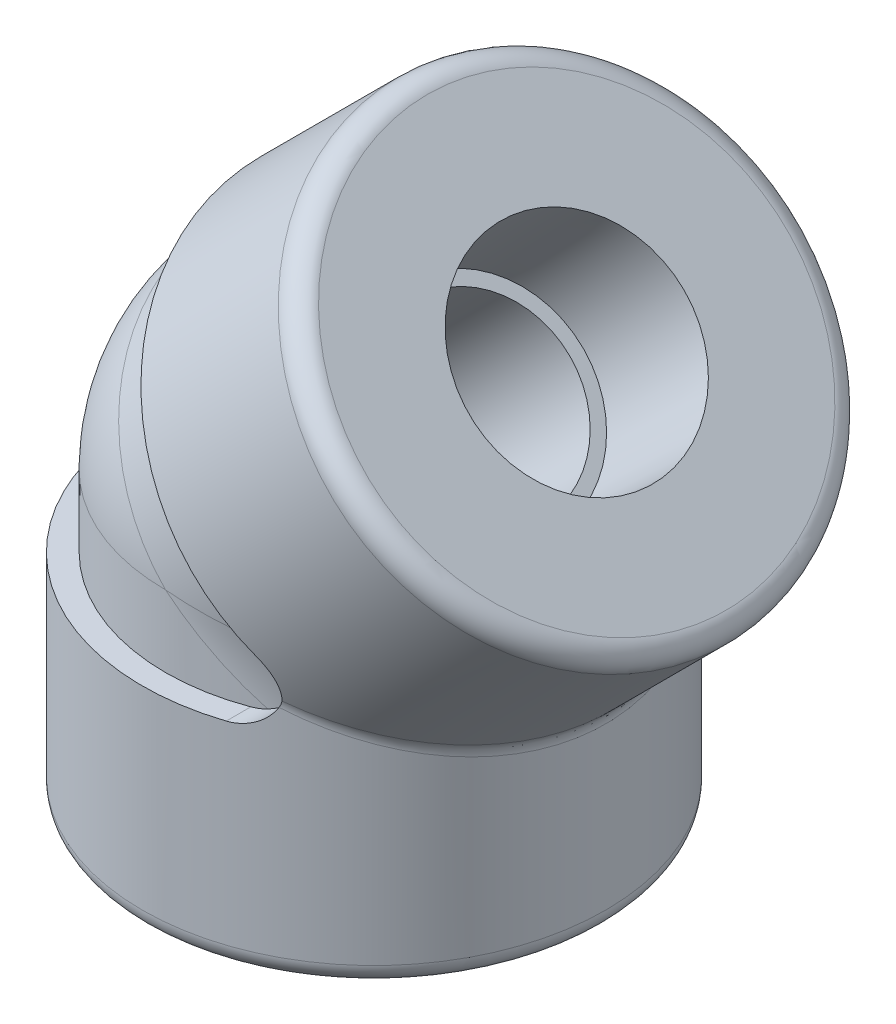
ISO-10303-21;
HEADER;
FILE_DESCRIPTION(('STEP AP214'),'2;1');
FILE_NAME('part.step','',(''),(''),'','','');
FILE_SCHEMA(('AUTOMOTIVE_DESIGN { 1 0 10303 214 1 1 1 1 }'));
ENDSEC;
DATA;
#1=APPLICATION_CONTEXT('core data for automotive mechanical design processes');
#2=APPLICATION_PROTOCOL_DEFINITION('international standard','automotive_design',2000,#1);
#3=PRODUCT_CONTEXT('',#1,'mechanical');
#4=PRODUCT('Part','Part','',(#3));
#5=PRODUCT_RELATED_PRODUCT_CATEGORY('part','',(#4));
#6=PRODUCT_DEFINITION_FORMATION('','',#4);
#7=PRODUCT_DEFINITION_CONTEXT('part definition',#1,'design');
#8=PRODUCT_DEFINITION('design','',#6,#7);
#9=PRODUCT_DEFINITION_SHAPE('','',#8);
#10=(LENGTH_UNIT() NAMED_UNIT(*) SI_UNIT(.MILLI.,.METRE.));
#11=(NAMED_UNIT(*) PLANE_ANGLE_UNIT() SI_UNIT($,.RADIAN.));
#12=(NAMED_UNIT(*) SI_UNIT($,.STERADIAN.) SOLID_ANGLE_UNIT());
#13=UNCERTAINTY_MEASURE_WITH_UNIT(LENGTH_MEASURE(1.E-05),#10,'distance_accuracy_value','');
#14=(GEOMETRIC_REPRESENTATION_CONTEXT(3) GLOBAL_UNCERTAINTY_ASSIGNED_CONTEXT((#13)) GLOBAL_UNIT_ASSIGNED_CONTEXT((#10,
#11,#12)) REPRESENTATION_CONTEXT('',''));
#15=CARTESIAN_POINT('',(0.,0.,0.));
#16=DIRECTION('',(0.,0.,1.));
#17=DIRECTION('',(1.,0.,0.));
#18=AXIS2_PLACEMENT_3D('',#15,#16,#17);
#19=CARTESIAN_POINT('',(0.,0.,20.6883));
#20=CARTESIAN_POINT('',(0.,0.,20.6883));
#21=CARTESIAN_POINT('',(0.,0.,20.6883));
#22=CARTESIAN_POINT('',(0.583291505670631,-0.0547339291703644,20.688309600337));
#23=CARTESIAN_POINT('',(0.517234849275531,-0.214245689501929,20.6883854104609));
#24=CARTESIAN_POINT('',(0.451152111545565,-0.373746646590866,20.688309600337));
#25=CARTESIAN_POINT('',(1.1665859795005,-0.109468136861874,20.6735428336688));
#26=CARTESIAN_POINT('',(1.03455713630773,-0.428527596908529,20.6692209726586));
#27=CARTESIAN_POINT('',(0.902306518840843,-0.747495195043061,20.6735428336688));
#28=CARTESIAN_POINT('',(2.33106013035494,-0.218738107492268,20.6145238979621));
#29=CARTESIAN_POINT('',(2.06567768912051,-0.855631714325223,20.59296602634));
#30=CARTESIAN_POINT('',(1.80297962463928,-1.49363722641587,20.6145238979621));
#31=CARTESIAN_POINT('',(2.91223974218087,-0.273273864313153,20.5702708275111));
#32=CARTESIAN_POINT('',(2.57968838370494,-1.06854191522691,20.5358426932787));
#33=CARTESIAN_POINT('',(2.25249827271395,-1.86603066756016,20.5702708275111));
#34=CARTESIAN_POINT('',(4.06889032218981,-0.381809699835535,20.4524929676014));
#35=CARTESIAN_POINT('',(3.5995851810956,-1.490997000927,20.3842918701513));
#36=CARTESIAN_POINT('',(3.14712016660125,-2.60715971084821,20.4524929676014));
#37=CARTESIAN_POINT('',(4.64437187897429,-0.435810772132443,20.3790411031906));
#38=CARTESIAN_POINT('',(4.1056911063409,-1.70063293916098,20.2898954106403));
#39=CARTESIAN_POINT('',(3.59223160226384,-2.97590209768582,20.3790411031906));
#40=CARTESIAN_POINT('',(5.78893798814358,-0.543212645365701,20.2030035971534));
#41=CARTESIAN_POINT('',(5.10786504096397,-2.11574697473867,20.0646852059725));
#42=CARTESIAN_POINT('',(4.47750665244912,-3.70928796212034,20.2030035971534));
#43=CARTESIAN_POINT('',(6.3580226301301,-0.596613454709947,20.1004183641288));
#44=CARTESIAN_POINT('',(5.60411824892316,-2.32130178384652,19.9337827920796));
#45=CARTESIAN_POINT('',(4.91767033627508,-4.07393149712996,20.1004183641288));
#46=CARTESIAN_POINT('',(7.48487730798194,-0.702353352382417,19.8668803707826));
#47=CARTESIAN_POINT('',(6.58107261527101,-2.7259695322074,19.637470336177));
#48=CARTESIAN_POINT('',(5.78924631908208,-4.7959686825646,19.8668803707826));
#49=CARTESIAN_POINT('',(8.04268905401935,-0.754696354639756,19.7360687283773));
#50=CARTESIAN_POINT('',(7.06200272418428,-2.92517730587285,19.4721193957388));
#51=CARTESIAN_POINT('',(6.22069087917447,-5.15338905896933,19.7360687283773));
#52=CARTESIAN_POINT('',(9.14778179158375,-0.858394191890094,19.4460198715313));
#53=CARTESIAN_POINT('',(8.0079710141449,-3.31701020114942,19.1079856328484));
#54=CARTESIAN_POINT('',(7.07543489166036,-5.86148218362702,19.4460198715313));
#55=CARTESIAN_POINT('',(9.6950609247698,-0.909748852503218,19.2867776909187));
#56=CARTESIAN_POINT('',(8.47314008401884,-3.50968953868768,18.9090672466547));
#57=CARTESIAN_POINT('',(7.49873290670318,-6.2121537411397,19.2867776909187));
#58=CARTESIAN_POINT('',(10.7730323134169,-1.01090172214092,18.9414201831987));
#59=CARTESIAN_POINT('',(9.38152697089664,-3.88595570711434,18.4811171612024));
#60=CARTESIAN_POINT('',(8.33249966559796,-6.90286873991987,18.9414201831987));
#61=CARTESIAN_POINT('',(11.3038133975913,-1.06070826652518,18.7554992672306));
#62=CARTESIAN_POINT('',(9.82498327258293,-4.06964132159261,18.252160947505));
#63=CARTESIAN_POINT('',(8.74303711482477,-7.24296909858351,18.7554992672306));
#64=CARTESIAN_POINT('',(12.3505323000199,-1.15892851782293,18.3563794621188));
#65=CARTESIAN_POINT('',(10.6908310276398,-4.42828720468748,17.7651365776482));
#66=CARTESIAN_POINT('',(9.55263135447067,-7.91365892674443,18.3563794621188));
#67=CARTESIAN_POINT('',(12.8664704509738,-1.20734225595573,18.1431811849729));
#68=CARTESIAN_POINT('',(11.1132907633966,-4.6032757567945,17.5069237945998));
#69=CARTESIAN_POINT('',(9.95168840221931,-8.24424860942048,18.1431811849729));
#70=CARTESIAN_POINT('',(13.8770188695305,-1.30216840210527,17.6919138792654));
#71=CARTESIAN_POINT('',(11.9313769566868,-4.94213815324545,16.966004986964));
#72=CARTESIAN_POINT('',(10.7333062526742,-8.89176203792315,17.6919138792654));
#73=CARTESIAN_POINT('',(14.3717721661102,-1.34859423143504,17.4540694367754));
#74=CARTESIAN_POINT('',(12.327241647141,-5.10611067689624,16.6833760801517));
#75=CARTESIAN_POINT('',(11.1159776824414,-9.20877743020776,17.4540694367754));
#76=CARTESIAN_POINT('',(15.3422127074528,-1.43965680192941,16.9526938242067));
#77=CARTESIAN_POINT('',(13.0939408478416,-5.42368788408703,16.0943454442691));
#78=CARTESIAN_POINT('',(11.866573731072,-9.83059155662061,16.9526938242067));
#79=CARTESIAN_POINT('',(15.8179040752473,-1.48429392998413,16.6891682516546));
#80=CARTESIAN_POINT('',(13.4647793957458,-5.57729424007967,15.7878166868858));
#81=CARTESIAN_POINT('',(12.2345015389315,-10.1353929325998,16.6891682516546));
#82=CARTESIAN_POINT('',(16.743704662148,-1.57116765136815,16.139709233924));
#83=CARTESIAN_POINT('',(14.1764557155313,-5.87208022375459,15.1566464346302));
#84=CARTESIAN_POINT('',(12.9505704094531,-10.7286038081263,16.139709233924));
#85=CARTESIAN_POINT('',(17.1940134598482,-1.61342297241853,15.8540115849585));
#86=CARTESIAN_POINT('',(14.5175216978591,-6.01335437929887,14.8320803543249));
#87=CARTESIAN_POINT('',(13.2988658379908,-11.017141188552,15.8540115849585));
#88=CARTESIAN_POINT('',(18.0715732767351,-1.6957699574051,15.2589473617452));
#89=CARTESIAN_POINT('',(15.1721947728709,-6.28452884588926,14.1650628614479));
#90=CARTESIAN_POINT('',(13.9776224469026,-11.5794415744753,15.2589473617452));
#91=CARTESIAN_POINT('',(18.4988298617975,-1.73586214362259,14.9495865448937));
#92=CARTESIAN_POINT('',(15.4857464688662,-6.41440621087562,13.8225234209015));
#93=CARTESIAN_POINT('',(14.3080879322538,-11.8532081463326,14.9495865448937));
#94=CARTESIAN_POINT('',(19.3240740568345,-1.81330002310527,14.3112938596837));
#95=CARTESIAN_POINT('',(16.0815694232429,-6.66120415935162,13.125842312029));
#96=CARTESIAN_POINT('',(14.9463805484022,-12.3819870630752,14.3112938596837));
#97=CARTESIAN_POINT('',(19.7223115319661,-1.85066916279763,13.9825885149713));
#98=CARTESIAN_POINT('',(16.3640469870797,-6.77821019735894,12.7717752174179));
#99=CARTESIAN_POINT('',(15.254400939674,-12.6371595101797,13.9825885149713));
#100=CARTESIAN_POINT('',(20.4919676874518,-1.92289086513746,13.3040020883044));
#101=CARTESIAN_POINT('',(16.9007193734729,-7.00050717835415,12.0516749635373));
#102=CARTESIAN_POINT('',(15.8496984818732,-13.1303201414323,13.3040020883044));
#103=CARTESIAN_POINT('',(20.8633930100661,-1.9577440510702,12.9541262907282));
#104=CARTESIAN_POINT('',(17.1548174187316,-7.10575803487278,11.685611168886));
#105=CARTESIAN_POINT('',(16.1369807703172,-13.3683125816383,12.9541262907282));
#106=CARTESIAN_POINT('',(21.5739465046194,-2.02441977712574,12.2378943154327));
#107=CARTESIAN_POINT('',(17.6323203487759,-7.30354622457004,10.947781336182));
#108=CARTESIAN_POINT('',(16.686564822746,-13.8236029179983,12.2378943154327));
#109=CARTESIAN_POINT('',(21.913356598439,-2.05626877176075,11.8717342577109));
#110=CARTESIAN_POINT('',(17.8558959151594,-7.3961542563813,10.5760942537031));
#111=CARTESIAN_POINT('',(16.9490846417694,-14.0410814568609,11.8717342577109));
#112=CARTESIAN_POINT('',(22.5619243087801,-2.11712797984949,11.1212235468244));
#113=CARTESIAN_POINT('',(18.275470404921,-7.56994770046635,9.82607765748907));
#114=CARTESIAN_POINT('',(17.4507252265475,-14.4566541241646,11.1212235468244));
#115=CARTESIAN_POINT('',(22.8710897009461,-2.14613892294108,10.7368776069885));
#116=CARTESIAN_POINT('',(18.4713553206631,-7.65108588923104,9.44778211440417));
#117=CARTESIAN_POINT('',(17.6898520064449,-14.6547532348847,10.7368776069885));
#118=CARTESIAN_POINT('',(23.454764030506,-2.20090877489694,9.9549462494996));
#119=CARTESIAN_POINT('',(18.8345445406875,-7.80152378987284,8.69008365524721));
#120=CARTESIAN_POINT('',(18.1413002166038,-15.0287451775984,9.9549462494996));
#121=CARTESIAN_POINT('',(23.7295590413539,-2.22669452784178,9.5575105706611));
#122=CARTESIAN_POINT('',(19.0019748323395,-7.87087568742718,8.31077436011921));
#123=CARTESIAN_POINT('',(18.3538429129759,-15.2048213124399,9.5575105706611));
#124=CARTESIAN_POINT('',(24.2459195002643,-2.27514789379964,8.74790993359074));
#125=CARTESIAN_POINT('',(19.3111589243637,-7.9989439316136,7.54963020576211));
#126=CARTESIAN_POINT('',(18.7532265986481,-15.5356815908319,8.74790993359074));
#127=CARTESIAN_POINT('',(24.4874936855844,-2.29781632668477,8.33574888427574));
#128=CARTESIAN_POINT('',(19.4528048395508,-8.05761559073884,7.16788890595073));
#129=CARTESIAN_POINT('',(18.9400743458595,-15.6904713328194,8.33574888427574));
#130=CARTESIAN_POINT('',(24.9342372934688,-2.33973710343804,7.50154646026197));
#131=CARTESIAN_POINT('',(19.7105061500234,-8.16435896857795,6.40612882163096));
#132=CARTESIAN_POINT('',(19.2856122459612,-15.9767243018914,7.50154646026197));
#133=CARTESIAN_POINT('',(25.1396674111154,-2.3590139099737,7.07960298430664));
#134=CARTESIAN_POINT('',(19.8266452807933,-8.21246537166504,6.02622909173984));
#135=CARTESIAN_POINT('',(19.44450403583,-16.1083545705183,7.07960298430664));
#136=CARTESIAN_POINT('',(25.5149703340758,-2.39423095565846,6.22476847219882));
#137=CARTESIAN_POINT('',(20.0357639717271,-8.29908516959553,5.26630040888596));
#138=CARTESIAN_POINT('',(19.7347854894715,-16.3488316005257,6.22476847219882));
#139=CARTESIAN_POINT('',(25.6848433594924,-2.4101712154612,5.79187750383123));
#140=CARTESIAN_POINT('',(20.1286531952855,-8.33756114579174,4.88641106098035));
#141=CARTESIAN_POINT('',(19.8661753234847,-16.457678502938,5.79187750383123));
#142=CARTESIAN_POINT('',(25.9870333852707,-2.43852761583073,4.91957907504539));
#143=CARTESIAN_POINT('',(20.2919007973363,-8.40518051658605,4.1292048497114));
#144=CARTESIAN_POINT('',(20.0999069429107,-16.6513081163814,4.91957907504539));
#145=CARTESIAN_POINT('',(26.1195517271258,-2.45096264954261,4.48022052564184));
#146=CARTESIAN_POINT('',(20.3623072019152,-8.43434380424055,3.75203709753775));
#147=CARTESIAN_POINT('',(20.2024044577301,-16.7362198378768,4.48022052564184));
#148=CARTESIAN_POINT('',(26.3473442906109,-2.47233786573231,3.59478402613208));
#149=CARTESIAN_POINT('',(20.4822376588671,-8.48402062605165,2.99839893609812));
#150=CARTESIAN_POINT('',(20.3785926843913,-16.8821789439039,3.59478402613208));
#151=CARTESIAN_POINT('',(26.4426186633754,-2.48127806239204,3.14870610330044));
#152=CARTESIAN_POINT('',(20.5317053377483,-8.50451080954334,2.62209722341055));
#153=CARTESIAN_POINT('',(20.4522835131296,-16.9432264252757,3.14870610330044));
#154=CARTESIAN_POINT('',(26.5950259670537,-2.49557940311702,2.2533122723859));
#155=CARTESIAN_POINT('',(20.6104007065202,-8.53710749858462,1.87117322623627));
#156=CARTESIAN_POINT('',(20.5701643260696,-17.0408820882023,2.2533122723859));
#157=CARTESIAN_POINT('',(26.6522677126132,-2.50095075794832,1.80400935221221));
#158=CARTESIAN_POINT('',(20.6396484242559,-8.54922229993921,1.4967250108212));
#159=CARTESIAN_POINT('',(20.614438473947,-17.0775599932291,1.80400935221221));
#160=CARTESIAN_POINT('',(26.7286360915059,-2.50811688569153,0.903137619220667));
#161=CARTESIAN_POINT('',(20.6786075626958,-8.56535970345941,0.748093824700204));
#162=CARTESIAN_POINT('',(20.6735062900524,-17.1264933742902,0.903137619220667));
#163=CARTESIAN_POINT('',(26.7477627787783,-2.5099116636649,0.451568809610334));
#164=CARTESIAN_POINT('',(20.6883,-8.56937444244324,0.374092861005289));
#165=CARTESIAN_POINT('',(20.6883,-17.1387488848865,0.451568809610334));
#166=CARTESIAN_POINT('',(26.7477627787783,-2.5099116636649,-0.451568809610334));
#167=CARTESIAN_POINT('',(20.6883,-8.56937444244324,-0.374092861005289));
#168=CARTESIAN_POINT('',(20.6883,-17.1387488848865,-0.451568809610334));
#169=CARTESIAN_POINT('',(26.7286360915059,-2.50811688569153,-0.903137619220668));
#170=CARTESIAN_POINT('',(20.6786075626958,-8.56535970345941,-0.748093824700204));
#171=CARTESIAN_POINT('',(20.6735062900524,-17.1264933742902,-0.903137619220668));
#172=CARTESIAN_POINT('',(26.6522677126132,-2.50095075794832,-1.80400935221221));
#173=CARTESIAN_POINT('',(20.6396484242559,-8.54922229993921,-1.4967250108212));
#174=CARTESIAN_POINT('',(20.614438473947,-17.0775599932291,-1.80400935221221));
#175=CARTESIAN_POINT('',(26.5950259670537,-2.49557940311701,-2.2533122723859));
#176=CARTESIAN_POINT('',(20.6104007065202,-8.53710749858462,-1.87117322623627));
#177=CARTESIAN_POINT('',(20.5701643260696,-17.0408820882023,-2.2533122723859));
#178=CARTESIAN_POINT('',(26.4426186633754,-2.48127806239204,-3.14870610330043));
#179=CARTESIAN_POINT('',(20.5317053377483,-8.50451080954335,-2.62209722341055));
#180=CARTESIAN_POINT('',(20.4522835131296,-16.9432264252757,-3.14870610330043));
#181=CARTESIAN_POINT('',(26.3473442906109,-2.47233786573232,-3.59478402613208));
#182=CARTESIAN_POINT('',(20.4822376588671,-8.48402062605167,-2.99839893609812));
#183=CARTESIAN_POINT('',(20.3785926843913,-16.882178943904,-3.59478402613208));
#184=CARTESIAN_POINT('',(26.1195517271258,-2.45096264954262,-4.48022052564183));
#185=CARTESIAN_POINT('',(20.3623072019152,-8.43434380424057,-3.75203709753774));
#186=CARTESIAN_POINT('',(20.2024044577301,-16.7362198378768,-4.48022052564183));
#187=CARTESIAN_POINT('',(25.9870333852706,-2.43852761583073,-4.91957907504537));
#188=CARTESIAN_POINT('',(20.2919007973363,-8.40518051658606,-4.12920484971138));
#189=CARTESIAN_POINT('',(20.0999069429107,-16.6513081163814,-4.91957907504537));
#190=CARTESIAN_POINT('',(25.6848433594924,-2.4101712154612,-5.79187750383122));
#191=CARTESIAN_POINT('',(20.1286531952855,-8.33756114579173,-4.88641106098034));
#192=CARTESIAN_POINT('',(19.8661753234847,-16.457678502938,-5.79187750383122));
#193=CARTESIAN_POINT('',(25.5149703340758,-2.39423095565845,-6.22476847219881));
#194=CARTESIAN_POINT('',(20.0357639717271,-8.29908516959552,-5.26630040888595));
#195=CARTESIAN_POINT('',(19.7347854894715,-16.3488316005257,-6.2247684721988));
#196=CARTESIAN_POINT('',(25.1396674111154,-2.35901390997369,-7.07960298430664));
#197=CARTESIAN_POINT('',(19.8266452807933,-8.21246537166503,-6.02622909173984));
#198=CARTESIAN_POINT('',(19.44450403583,-16.1083545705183,-7.07960298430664));
#199=CARTESIAN_POINT('',(24.9342372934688,-2.33973710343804,-7.50154646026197));
#200=CARTESIAN_POINT('',(19.7105061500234,-8.16435896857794,-6.40612882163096));
#201=CARTESIAN_POINT('',(19.2856122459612,-15.9767243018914,-7.50154646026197));
#202=CARTESIAN_POINT('',(24.4874936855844,-2.29781632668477,-8.33574888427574));
#203=CARTESIAN_POINT('',(19.4528048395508,-8.05761559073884,-7.16788890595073));
#204=CARTESIAN_POINT('',(18.9400743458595,-15.6904713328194,-8.33574888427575));
#205=CARTESIAN_POINT('',(24.2459195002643,-2.27514789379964,-8.74790993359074));
#206=CARTESIAN_POINT('',(19.3111589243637,-7.99894393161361,-7.54963020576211));
#207=CARTESIAN_POINT('',(18.7532265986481,-15.5356815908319,-8.74790993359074));
#208=CARTESIAN_POINT('',(23.7295590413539,-2.22669452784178,-9.55751057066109));
#209=CARTESIAN_POINT('',(19.0019748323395,-7.87087568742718,-8.3107743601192));
#210=CARTESIAN_POINT('',(18.3538429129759,-15.2048213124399,-9.55751057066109));
#211=CARTESIAN_POINT('',(23.454764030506,-2.20090877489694,-9.9549462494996));
#212=CARTESIAN_POINT('',(18.8345445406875,-7.80152378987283,-8.6900836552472));
#213=CARTESIAN_POINT('',(18.1413002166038,-15.0287451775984,-9.9549462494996));
#214=CARTESIAN_POINT('',(22.8710897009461,-2.14613892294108,-10.7368776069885));
#215=CARTESIAN_POINT('',(18.4713553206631,-7.65108588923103,-9.44778211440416));
#216=CARTESIAN_POINT('',(17.6898520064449,-14.6547532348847,-10.7368776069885));
#217=CARTESIAN_POINT('',(22.5619243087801,-2.11712797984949,-11.1212235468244));
#218=CARTESIAN_POINT('',(18.275470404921,-7.56994770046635,-9.82607765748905));
#219=CARTESIAN_POINT('',(17.4507252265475,-14.4566541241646,-11.1212235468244));
#220=CARTESIAN_POINT('',(21.913356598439,-2.05626877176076,-11.8717342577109));
#221=CARTESIAN_POINT('',(17.8558959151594,-7.39615425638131,-10.576094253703));
#222=CARTESIAN_POINT('',(16.9490846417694,-14.0410814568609,-11.8717342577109));
#223=CARTESIAN_POINT('',(21.5739465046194,-2.02441977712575,-12.2378943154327));
#224=CARTESIAN_POINT('',(17.6323203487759,-7.30354622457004,-10.947781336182));
#225=CARTESIAN_POINT('',(16.686564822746,-13.8236029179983,-12.2378943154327));
#226=CARTESIAN_POINT('',(20.8633930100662,-1.9577440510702,-12.9541262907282));
#227=CARTESIAN_POINT('',(17.1548174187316,-7.10575803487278,-11.685611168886));
#228=CARTESIAN_POINT('',(16.1369807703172,-13.3683125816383,-12.9541262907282));
#229=CARTESIAN_POINT('',(20.4919676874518,-1.92289086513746,-13.3040020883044));
#230=CARTESIAN_POINT('',(16.9007193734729,-7.00050717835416,-12.0516749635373));
#231=CARTESIAN_POINT('',(15.8496984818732,-13.1303201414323,-13.3040020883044));
#232=CARTESIAN_POINT('',(19.7223115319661,-1.85066916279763,-13.9825885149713));
#233=CARTESIAN_POINT('',(16.3640469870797,-6.77821019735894,-12.7717752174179));
#234=CARTESIAN_POINT('',(15.254400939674,-12.6371595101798,-13.9825885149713));
#235=CARTESIAN_POINT('',(19.3240740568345,-1.81330002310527,-14.3112938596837));
#236=CARTESIAN_POINT('',(16.0815694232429,-6.66120415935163,-13.125842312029));
#237=CARTESIAN_POINT('',(14.9463805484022,-12.3819870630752,-14.3112938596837));
#238=CARTESIAN_POINT('',(18.4988298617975,-1.73586214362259,-14.9495865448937));
#239=CARTESIAN_POINT('',(15.4857464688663,-6.41440621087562,-13.8225234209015));
#240=CARTESIAN_POINT('',(14.3080879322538,-11.8532081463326,-14.9495865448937));
#241=CARTESIAN_POINT('',(18.0715732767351,-1.6957699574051,-15.2589473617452));
#242=CARTESIAN_POINT('',(15.1721947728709,-6.28452884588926,-14.1650628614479));
#243=CARTESIAN_POINT('',(13.9776224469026,-11.5794415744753,-15.2589473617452));
#244=CARTESIAN_POINT('',(17.1940134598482,-1.61342297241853,-15.8540115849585));
#245=CARTESIAN_POINT('',(14.5175216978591,-6.01335437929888,-14.8320803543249));
#246=CARTESIAN_POINT('',(13.2988658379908,-11.017141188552,-15.8540115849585));
#247=CARTESIAN_POINT('',(16.7437046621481,-1.57116765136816,-16.139709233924));
#248=CARTESIAN_POINT('',(14.1764557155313,-5.8720802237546,-15.1566464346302));
#249=CARTESIAN_POINT('',(12.9505704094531,-10.7286038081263,-16.139709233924));
#250=CARTESIAN_POINT('',(15.8179040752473,-1.48429392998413,-16.6891682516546));
#251=CARTESIAN_POINT('',(13.4647793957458,-5.57729424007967,-15.7878166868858));
#252=CARTESIAN_POINT('',(12.2345015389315,-10.1353929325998,-16.6891682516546));
#253=CARTESIAN_POINT('',(15.3422127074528,-1.43965680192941,-16.9526938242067));
#254=CARTESIAN_POINT('',(13.0939408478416,-5.42368788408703,-16.0943454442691));
#255=CARTESIAN_POINT('',(11.866573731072,-9.83059155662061,-16.9526938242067));
#256=CARTESIAN_POINT('',(14.3717721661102,-1.34859423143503,-17.4540694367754));
#257=CARTESIAN_POINT('',(12.3272416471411,-5.10611067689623,-16.6833760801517));
#258=CARTESIAN_POINT('',(11.1159776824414,-9.20877743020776,-17.4540694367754));
#259=CARTESIAN_POINT('',(13.8770188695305,-1.30216840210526,-17.6919138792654));
#260=CARTESIAN_POINT('',(11.9313769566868,-4.94213815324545,-16.966004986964));
#261=CARTESIAN_POINT('',(10.7333062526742,-8.89176203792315,-17.6919138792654));
#262=CARTESIAN_POINT('',(12.8664704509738,-1.20734225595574,-18.1431811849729));
#263=CARTESIAN_POINT('',(11.1132907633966,-4.6032757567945,-17.5069237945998));
#264=CARTESIAN_POINT('',(9.95168840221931,-8.24424860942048,-18.1431811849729));
#265=CARTESIAN_POINT('',(12.3505323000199,-1.15892851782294,-18.3563794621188));
#266=CARTESIAN_POINT('',(10.6908310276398,-4.42828720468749,-17.7651365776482));
#267=CARTESIAN_POINT('',(9.55263135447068,-7.91365892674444,-18.3563794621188));
#268=CARTESIAN_POINT('',(11.3038133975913,-1.06070826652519,-18.7554992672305));
#269=CARTESIAN_POINT('',(9.82498327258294,-4.06964132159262,-18.252160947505));
#270=CARTESIAN_POINT('',(8.74303711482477,-7.24296909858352,-18.7554992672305));
#271=CARTESIAN_POINT('',(10.773032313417,-1.01090172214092,-18.9414201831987));
#272=CARTESIAN_POINT('',(9.38152697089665,-3.88595570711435,-18.4811171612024));
#273=CARTESIAN_POINT('',(8.33249966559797,-6.90286873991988,-18.9414201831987));
#274=CARTESIAN_POINT('',(9.69506092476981,-0.909748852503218,-19.2867776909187));
#275=CARTESIAN_POINT('',(8.47314008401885,-3.50968953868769,-18.9090672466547));
#276=CARTESIAN_POINT('',(7.49873290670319,-6.21215374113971,-19.2867776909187));
#277=CARTESIAN_POINT('',(9.14778179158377,-0.858394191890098,-19.4460198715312));
#278=CARTESIAN_POINT('',(8.00797101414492,-3.31701020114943,-19.1079856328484));
#279=CARTESIAN_POINT('',(7.07543489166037,-5.86148218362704,-19.4460198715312));
#280=CARTESIAN_POINT('',(8.04268905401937,-0.75469635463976,-19.7360687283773));
#281=CARTESIAN_POINT('',(7.0620027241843,-2.92517730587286,-19.4721193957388));
#282=CARTESIAN_POINT('',(6.22069087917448,-5.15338905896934,-19.7360687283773));
#283=CARTESIAN_POINT('',(7.48487730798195,-0.702353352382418,-19.8668803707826));
#284=CARTESIAN_POINT('',(6.58107261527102,-2.72596953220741,-19.637470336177));
#285=CARTESIAN_POINT('',(5.78924631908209,-4.79596868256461,-19.8668803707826));
#286=CARTESIAN_POINT('',(6.35802263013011,-0.596613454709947,-20.1004183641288));
#287=CARTESIAN_POINT('',(5.60411824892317,-2.32130178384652,-19.9337827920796));
#288=CARTESIAN_POINT('',(4.91767033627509,-4.07393149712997,-20.1004183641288));
#289=CARTESIAN_POINT('',(5.7889379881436,-0.543212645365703,-20.2030035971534));
#290=CARTESIAN_POINT('',(5.10786504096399,-2.11574697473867,-20.0646852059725));
#291=CARTESIAN_POINT('',(4.47750665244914,-3.70928796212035,-20.2030035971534));
#292=CARTESIAN_POINT('',(4.64437187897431,-0.435810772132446,-20.3790411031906));
#293=CARTESIAN_POINT('',(4.10569110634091,-1.70063293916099,-20.2898954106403));
#294=CARTESIAN_POINT('',(3.59223160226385,-2.97590209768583,-20.3790411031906));
#295=CARTESIAN_POINT('',(4.06889032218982,-0.381809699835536,-20.4524929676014));
#296=CARTESIAN_POINT('',(3.59958518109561,-1.490997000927,-20.3842918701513));
#297=CARTESIAN_POINT('',(3.14712016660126,-2.60715971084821,-20.4524929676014));
#298=CARTESIAN_POINT('',(2.91223974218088,-0.273273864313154,-20.5702708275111));
#299=CARTESIAN_POINT('',(2.57968838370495,-1.06854191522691,-20.5358426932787));
#300=CARTESIAN_POINT('',(2.25249827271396,-1.86603066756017,-20.5702708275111));
#301=CARTESIAN_POINT('',(2.33106013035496,-0.21873810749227,-20.6145238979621));
#302=CARTESIAN_POINT('',(2.06567768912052,-0.855631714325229,-20.59296602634));
#303=CARTESIAN_POINT('',(1.80297962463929,-1.49363722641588,-20.6145238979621));
#304=CARTESIAN_POINT('',(1.16658597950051,-0.109468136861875,-20.6735428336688));
#305=CARTESIAN_POINT('',(1.03455713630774,-0.428527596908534,-20.6692209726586));
#306=CARTESIAN_POINT('',(0.902306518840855,-0.747495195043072,-20.6735428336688));
#307=CARTESIAN_POINT('',(0.583291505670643,-0.0547339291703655,-20.688309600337));
#308=CARTESIAN_POINT('',(0.517234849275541,-0.214245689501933,-20.6883854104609));
#309=CARTESIAN_POINT('',(0.451152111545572,-0.373746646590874,-20.688309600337));
#310=CARTESIAN_POINT('',(0.,0.,-20.6883));
#311=CARTESIAN_POINT('',(0.,0.,-20.6883));
#312=CARTESIAN_POINT('',(0.,0.,-20.6883));
#313=(BOUNDED_SURFACE() B_SPLINE_SURFACE(3,2,((#19,#20,#21),(#22,#23,#24),(#25,#26,#27),(#28,
#29,#30),(#31,#32,#33),(#34,#35,#36),(#37,#38,#39),(#40,#41,#42),(#43,#44,#45),(#46,#47,#48),
(#49,#50,#51),(#52,#53,#54),(#55,#56,#57),(#58,#59,#60),(#61,#62,#63),(#64,#65,#66),(#67,#68,
#69),(#70,#71,#72),(#73,#74,#75),(#76,#77,#78),(#79,#80,#81),(#82,#83,#84),(#85,#86,#87),(#88,
#89,#90),(#91,#92,#93),(#94,#95,#96),(#97,#98,#99),(#100,#101,#102),(#103,#104,#105),(#106,#107,
#108),(#109,#110,#111),(#112,#113,#114),(#115,#116,#117),(#118,#119,#120),(#121,#122,#123),
(#124,#125,#126),(#127,#128,#129),(#130,#131,#132),(#133,#134,#135),(#136,#137,#138),(#139,#140,
#141),(#142,#143,#144),(#145,#146,#147),(#148,#149,#150),(#151,#152,#153),(#154,#155,#156),
(#157,#158,#159),(#160,#161,#162),(#163,#164,#165),(#166,#167,#168),(#169,#170,#171),(#172,#173,
#174),(#175,#176,#177),(#178,#179,#180),(#181,#182,#183),(#184,#185,#186),(#187,#188,#189),
(#190,#191,#192),(#193,#194,#195),(#196,#197,#198),(#199,#200,#201),(#202,#203,#204),(#205,#206,
#207),(#208,#209,#210),(#211,#212,#213),(#214,#215,#216),(#217,#218,#219),(#220,#221,#222),
(#223,#224,#225),(#226,#227,#228),(#229,#230,#231),(#232,#233,#234),(#235,#236,#237),(#238,#239,
#240),(#241,#242,#243),(#244,#245,#246),(#247,#248,#249),(#250,#251,#252),(#253,#254,#255),
(#256,#257,#258),(#259,#260,#261),(#262,#263,#264),(#265,#266,#267),(#268,#269,#270),(#271,#272,
#273),(#274,#275,#276),(#277,#278,#279),(#280,#281,#282),(#283,#284,#285),(#286,#287,#288),
(#289,#290,#291),(#292,#293,#294),(#295,#296,#297),(#298,#299,#300),(#301,#302,#303),(#304,#305,
#306),(#307,#308,#309),(#310,#311,#312)),.UNSPECIFIED.,.F.,.F.,
.F.) B_SPLINE_SURFACE_WITH_KNOTS((4,2,2,2,2,2,2,2,2,2,2,2,2,2,2,2,2,2,2,2,2,2,2,2,2,2,2,2,2,2,2,
2,2,2,2,2,2,2,2,2,2,2,2,2,2,2,2,2,4),(3,3),(0.,2.9295037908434,5.85909714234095,
8.78141924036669,11.7037003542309,14.6116967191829,17.520201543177,20.4084971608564,
23.2967279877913,26.1606338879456,29.0239169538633,31.8600888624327,34.695572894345,
37.5027156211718,40.3091605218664,43.0879808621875,45.8660849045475,48.619261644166,
51.3717128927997,54.1034159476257,56.8351020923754,59.5517699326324,62.2684267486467,
64.9772771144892,67.6861236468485,70.3949701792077,73.1038205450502,75.8204773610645,
78.5371452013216,81.2688313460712,84.0005344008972,86.7529856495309,89.5061623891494,
92.2842664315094,95.0630867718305,97.8695316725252,100.676674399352,103.512158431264,
106.348330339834,109.211613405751,112.075519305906,114.963750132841,117.85204575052,
120.760550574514,123.668546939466,126.59082805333,129.513150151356,132.442743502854,
135.372247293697),(0.,1.),
.UNSPECIFIED.) GEOMETRIC_REPRESENTATION_ITEM() RATIONAL_B_SPLINE_SURFACE(((1.,1.,1.),(1.,
1.00000047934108,1.),(1.,0.999895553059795,1.),(1.,0.99947831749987,1.),(1.,0.999166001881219,
1.),(1.,0.998338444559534,1.),(1.,0.997823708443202,1.),(1.,0.996598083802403,1.),(1.,
0.995887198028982,1.),(1.,0.994282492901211,1.),(1.,0.993389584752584,1.),(1.,0.991430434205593,
1.),(1.,0.990364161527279,1.),(1.,0.988080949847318,1.),(1.,0.986865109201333,1.),(1.,
0.984293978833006,1.),(1.,0.982938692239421,1.),(1.,0.980120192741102,1.),(1.,0.978657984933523,
1.),(1.,0.975637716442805,1.),(1.,0.974079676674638,1.),(1.,0.970906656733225,1.),(1.,
0.969292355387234,1.),(1.,0.966019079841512,1.),(1.,0.964360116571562,1.),(1.,0.961041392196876,
1.),(1.,0.959381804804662,1.),(1.,0.95607422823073,1.),(1.,0.954426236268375,1.),(1.,
0.951186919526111,1.),(1.,0.949595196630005,1.),(1.,0.94648116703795,1.),(1.,0.944958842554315,
1.),(1.,0.942025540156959,1.),(1.,0.940613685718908,1.),(1.,0.937914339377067,1.),(1.,
0.936626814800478,1.),(1.,0.934211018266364,1.),(1.,0.933081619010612,1.),(1.,0.930994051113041,
1.),(1.,0.930035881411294,1.),(1.,0.92831592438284,1.),(1.,0.927553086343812,1.),(1.,
0.926233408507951,1.),(1.,0.925676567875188,1.),(1.,0.924782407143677,1.),(1.,0.924444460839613,
1.),(1.,0.92399302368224,1.),(1.,0.923879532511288,1.),(1.,0.923879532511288,1.),(1.,
0.92399302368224,1.),(1.,0.924444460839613,1.),(1.,0.924782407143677,1.),(1.,0.925676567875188,
1.),(1.,0.926233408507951,1.),(1.,0.927553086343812,1.),(1.,0.92831592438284,1.),(1.,
0.930035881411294,1.),(1.,0.930994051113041,1.),(1.,0.933081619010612,1.),(1.,0.934211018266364,
1.),(1.,0.936626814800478,1.),(1.,0.937914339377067,1.),(1.,0.940613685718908,1.),(1.,
0.942025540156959,1.),(1.,0.944958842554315,1.),(1.,0.94648116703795,1.),(1.,0.949595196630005,
1.),(1.,0.951186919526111,1.),(1.,0.954426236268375,1.),(1.,0.95607422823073,1.),(1.,
0.959381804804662,1.),(1.,0.961041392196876,1.),(1.,0.964360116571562,1.),(1.,0.966019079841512,
1.),(1.,0.969292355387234,1.),(1.,0.970906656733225,1.),(1.,0.974079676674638,1.),(1.,
0.975637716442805,1.),(1.,0.978657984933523,1.),(1.,0.980120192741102,1.),(1.,0.982938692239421,
1.),(1.,0.984293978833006,1.),(1.,0.986865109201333,1.),(1.,0.988080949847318,1.),(1.,
0.990364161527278,1.),(1.,0.991430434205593,1.),(1.,0.993389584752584,1.),(1.,0.994282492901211,
1.),(1.,0.995887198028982,1.),(1.,0.996598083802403,1.),(1.,0.997823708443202,1.),(1.,
0.998338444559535,1.),(1.,0.999166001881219,1.),(1.,0.99947831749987,1.),(1.,0.999895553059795,
1.),(1.,1.00000047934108,1.),(1.,1.,1.))) REPRESENTATION_ITEM('') SURFACE());
#314=CARTESIAN_POINT('',(0.,0.,0.));
#315=DIRECTION('',(-0.637951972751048,-0.770076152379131,0.));
#316=DIRECTION('',(0.770076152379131,-0.637951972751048,0.));
#317=AXIS2_PLACEMENT_3D('',#314,#315,#316);
#318=ELLIPSE('',#317,26.8652651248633,20.6883);
#319=CARTESIAN_POINT('',(8.37306161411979,-6.9364713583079,18.9181816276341));
#320=VERTEX_POINT('',#319);
#321=CARTESIAN_POINT('',(0.,0.,20.6883));
#322=VERTEX_POINT('',#321);
#323=EDGE_CURVE('E129',#320,#322,#318,.T.);
#324=ORIENTED_EDGE('',*,*,#323,.F.);
#325=CARTESIAN_POINT('',(8.37306161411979,-6.9364713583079,18.9181816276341));
#326=CARTESIAN_POINT('',(8.48283162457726,-6.90341503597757,18.8696030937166));
#327=CARTESIAN_POINT('',(8.59131149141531,-6.86581129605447,18.821389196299));
#328=CARTESIAN_POINT('',(8.80535880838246,-6.78143726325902,18.7263424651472));
#329=CARTESIAN_POINT('',(8.91092437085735,-6.73466118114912,18.6795105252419));
#330=CARTESIAN_POINT('',(9.22431793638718,-6.57966087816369,18.5413770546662));
#331=CARTESIAN_POINT('',(9.4269529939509,-6.45732644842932,18.4532915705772));
#332=CARTESIAN_POINT('',(9.71617006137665,-6.24633877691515,18.3328901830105));
#333=CARTESIAN_POINT('',(9.81037411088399,-6.17116744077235,18.2946160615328));
#334=CARTESIAN_POINT('',(9.99287036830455,-6.01185895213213,18.2230100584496));
#335=CARTESIAN_POINT('',(10.0811662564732,-5.92772746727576,18.1896750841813));
#336=CARTESIAN_POINT('',(10.2505940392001,-5.75118179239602,18.1290056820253));
#337=CARTESIAN_POINT('',(10.3317512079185,-5.65879936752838,18.101649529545));
#338=CARTESIAN_POINT('',(10.4862449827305,-5.46608380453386,18.0536765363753));
#339=CARTESIAN_POINT('',(10.5595834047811,-5.36575252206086,18.0330581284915));
#340=CARTESIAN_POINT('',(10.688104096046,-5.17204786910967,18.0015842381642));
#341=CARTESIAN_POINT('',(10.7444007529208,-5.07956494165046,17.9897862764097));
#342=CARTESIAN_POINT('',(10.8497661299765,-4.89003185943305,17.9721366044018));
#343=CARTESIAN_POINT('',(10.898835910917,-4.79298237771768,17.9662840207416));
#344=CARTESIAN_POINT('',(10.9892360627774,-4.59515808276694,17.9607033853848));
#345=CARTESIAN_POINT('',(11.0305654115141,-4.49438277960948,17.9609761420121));
#346=CARTESIAN_POINT('',(11.1050904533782,-4.29007172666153,17.9676413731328));
#347=CARTESIAN_POINT('',(11.1382866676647,-4.18653615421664,17.9740334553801));
#348=CARTESIAN_POINT('',(11.1927702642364,-3.99046359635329,17.9915898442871));
#349=CARTESIAN_POINT('',(11.2150176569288,-3.89813041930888,18.0020747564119));
#350=CARTESIAN_POINT('',(11.2530381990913,-3.71271427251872,18.0273604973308));
#351=CARTESIAN_POINT('',(11.2688092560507,-3.61963107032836,18.042162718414));
#352=CARTESIAN_POINT('',(11.3064124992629,-3.34025210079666,18.0925792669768));
#353=CARTESIAN_POINT('',(11.3185839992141,-3.15364747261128,18.1342204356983));
#354=CARTESIAN_POINT('',(11.3180985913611,-2.77302949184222,18.2332860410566));
#355=CARTESIAN_POINT('',(11.3039214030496,-2.57923589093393,18.2915021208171));
#356=CARTESIAN_POINT('',(11.2495661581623,-2.19882065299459,18.4185461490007));
#357=CARTESIAN_POINT('',(11.2093680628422,-2.01220466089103,18.4873822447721));
#358=CARTESIAN_POINT('',(11.1160874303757,-1.68789311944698,18.6163332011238));
#359=CARTESIAN_POINT('',(11.0676343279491,-1.5483071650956,18.6751404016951));
#360=CARTESIAN_POINT('',(10.9567951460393,-1.27648828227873,18.7951879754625));
#361=CARTESIAN_POINT('',(10.8944552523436,-1.14423275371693,18.8564197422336));
#362=CARTESIAN_POINT('',(10.8254745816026,-1.01582271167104,18.9181816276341));
#363=B_SPLINE_CURVE_WITH_KNOTS('',3,(#325,#326,#327,#328,#329,#330,#331,#332,#333,#334,#335,
#336,#337,#338,#339,#340,#341,#342,#343,#344,#345,#346,#347,#348,#349,#350,#351,#352,#353,#354,
#355,#356,#357,#358,#359,#360,#361,#362),.UNSPECIFIED.,.F.,.F.,(4,2,2,2,2,2,2,2,2,2,2,2,2,2,2,2,
2,2,4),(0.,0.373276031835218,0.746788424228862,1.50019130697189,1.8791208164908,
2.25781204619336,2.63510350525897,3.01230714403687,3.33856537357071,3.66477566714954,
3.99102900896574,4.31726143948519,4.60358826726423,4.89000753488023,5.46229190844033,
6.06862502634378,6.6754256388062,7.15174153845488,7.62649631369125),.UNSPECIFIED.);
#364=CARTESIAN_POINT('',(10.8254745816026,-1.01582271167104,18.9181816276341));
#365=VERTEX_POINT('',#364);
#366=EDGE_CURVE('E289',#320,#365,#363,.T.);
#367=ORIENTED_EDGE('',*,*,#366,.T.);
#368=CARTESIAN_POINT('',(0.,0.,0.));
#369=DIRECTION('',(-0.0934259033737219,-0.99562623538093,0.));
#370=DIRECTION('',(0.99562623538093,-0.0934259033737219,0.));
#371=AXIS2_PLACEMENT_3D('',#368,#369,#370);
#372=ELLIPSE('',#371,26.8652651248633,20.6883);
#373=EDGE_CURVE('E118',#322,#365,#372,.F.);
#374=ORIENTED_EDGE('',*,*,#373,.F.);
#375=EDGE_LOOP('',(#324,#367,#374));
#376=FACE_BOUND('',#375,.T.);
#377=ADVANCED_FACE('F31',(#376),#313,.F.);
#378=CARTESIAN_POINT('',(10.8254745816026,-1.01582271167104,-18.9181816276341));
#379=VERTEX_POINT('',#378);
#380=CARTESIAN_POINT('',(0.,0.,-20.6883));
#381=VERTEX_POINT('',#380);
#382=EDGE_CURVE('E108',#379,#381,#372,.F.);
#383=ORIENTED_EDGE('',*,*,#382,.F.);
#384=CARTESIAN_POINT('',(10.8254745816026,-1.01582271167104,-18.9181816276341));
#385=CARTESIAN_POINT('',(10.8797193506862,-1.11681618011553,-18.8696030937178));
#386=CARTESIAN_POINT('',(10.9298363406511,-1.22011288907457,-18.8213891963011));
#387=CARTESIAN_POINT('',(11.0215291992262,-1.43112864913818,-18.726342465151));
#388=CARTESIAN_POINT('',(11.0630996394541,-1.53885045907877,-18.6795105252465));
#389=CARTESIAN_POINT('',(11.1751005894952,-1.87005493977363,-18.5413770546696));
#390=CARTESIAN_POINT('',(11.2318817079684,-2.09984306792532,-18.453291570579));
#391=CARTESIAN_POINT('',(11.2871982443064,-2.45354123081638,-18.3328901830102));
#392=CARTESIAN_POINT('',(11.3006564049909,-2.57330771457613,-18.2946160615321));
#393=CARTESIAN_POINT('',(11.317052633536,-2.8150001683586,-18.2230100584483));
#394=CARTESIAN_POINT('',(11.3199973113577,-2.93692473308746,-18.18967508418));
#395=CARTESIAN_POINT('',(11.3149642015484,-3.18156491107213,-18.1290056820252));
#396=CARTESIAN_POINT('',(11.3070267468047,-3.30427593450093,-18.1016495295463));
#397=CARTESIAN_POINT('',(11.2799998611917,-3.54979001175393,-18.0536765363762));
#398=CARTESIAN_POINT('',(11.2609130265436,-3.67259303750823,-18.0330581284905));
#399=CARTESIAN_POINT('',(11.2148210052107,-3.90044076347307,-18.0015842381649));
#400=CARTESIAN_POINT('',(11.1892334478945,-4.00564381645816,-17.9897862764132));
#401=CARTESIAN_POINT('',(11.1297178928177,-4.21416851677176,-17.9721366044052));
#402=CARTESIAN_POINT('',(11.0957911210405,-4.31749043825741,-17.966284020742));
#403=CARTESIAN_POINT('',(11.0198307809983,-4.52129589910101,-17.9607033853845));
#404=CARTESIAN_POINT('',(10.9777961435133,-4.62177906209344,-17.960976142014));
#405=CARTESIAN_POINT('',(10.8860235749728,-4.81894595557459,-17.9676413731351));
#406=CARTESIAN_POINT('',(10.8362861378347,-4.91562992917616,-17.9740334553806));
#407=CARTESIAN_POINT('',(10.7361676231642,-5.09279988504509,-17.9915898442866));
#408=CARTESIAN_POINT('',(10.6866094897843,-5.17382058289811,-18.002074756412));
#409=CARTESIAN_POINT('',(10.5823850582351,-5.33181418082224,-18.0273604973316));
#410=CARTESIAN_POINT('',(10.5277171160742,-5.40878576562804,-18.042162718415));
#411=CARTESIAN_POINT('',(10.3567558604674,-5.63292603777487,-18.0925792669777));
#412=CARTESIAN_POINT('',(10.2334130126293,-5.77348198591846,-18.1342204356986));
#413=CARTESIAN_POINT('',(9.96393222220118,-6.04227630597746,-18.2332860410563));
#414=CARTESIAN_POINT('',(9.81687466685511,-6.1692842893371,-18.2915021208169));
#415=CARTESIAN_POINT('',(9.50944551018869,-6.3998435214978,-18.4185461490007));
#416=CARTESIAN_POINT('',(9.34906373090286,-6.50337660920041,-18.4873822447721));
#417=CARTESIAN_POINT('',(9.05378147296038,-6.66674013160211,-18.6163332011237));
#418=CARTESIAN_POINT('',(8.92081778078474,-6.73118078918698,-18.6751404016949));
#419=CARTESIAN_POINT('',(8.65023766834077,-6.84501062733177,-18.7951879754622));
#420=CARTESIAN_POINT('',(8.51263792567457,-6.89444844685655,-18.8564197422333));
#421=CARTESIAN_POINT('',(8.37306161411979,-6.9364713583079,-18.9181816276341));
#422=B_SPLINE_CURVE_WITH_KNOTS('',3,(#384,#385,#386,#387,#388,#389,#390,#391,#392,#393,#394,
#395,#396,#397,#398,#399,#400,#401,#402,#403,#404,#405,#406,#407,#408,#409,#410,#411,#412,#413,
#414,#415,#416,#417,#418,#419,#420,#421),.UNSPECIFIED.,.F.,.F.,(4,2,2,2,2,2,2,2,2,2,2,2,2,2,2,2,
2,2,4),(0.,0.373276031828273,0.74678842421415,1.50019130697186,1.87912081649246,
2.25781204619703,2.63510350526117,3.01230714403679,3.33856537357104,3.66477566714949,
3.99102900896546,4.31726143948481,4.60358826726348,4.89000753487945,5.46229190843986,
6.06862502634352,6.67542563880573,7.15174153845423,7.62649631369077),.UNSPECIFIED.);
#423=CARTESIAN_POINT('',(8.37306161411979,-6.9364713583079,-18.9181816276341));
#424=VERTEX_POINT('',#423);
#425=EDGE_CURVE('E125',#379,#424,#422,.T.);
#426=ORIENTED_EDGE('',*,*,#425,.T.);
#427=EDGE_CURVE('E122',#381,#424,#318,.T.);
#428=ORIENTED_EDGE('',*,*,#427,.F.);
#429=EDGE_LOOP('',(#383,#426,#428));
#430=FACE_BOUND('',#429,.T.);
#431=ADVANCED_FACE('F124',(#430),#313,.F.);
#432=CARTESIAN_POINT('',(0.,0.,0.));
#433=DIRECTION('',(0.707106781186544,0.707106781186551,0.));
#434=DIRECTION('',(-0.707106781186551,0.707106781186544,0.));
#435=AXIS2_PLACEMENT_3D('',#432,#433,#434);
#436=CYLINDRICAL_SURFACE('',#435,20.6883);
#437=ORIENTED_EDGE('',*,*,#373,.T.);
#438=CARTESIAN_POINT('',(10.8254745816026,-1.01582271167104,18.9181816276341));
#439=CARTESIAN_POINT('',(10.7780502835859,-0.927562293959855,18.9606505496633));
#440=CARTESIAN_POINT('',(10.7273427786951,-0.84088950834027,19.0027673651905));
#441=CARTESIAN_POINT('',(10.6197856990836,-0.671542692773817,19.0858565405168));
#442=CARTESIAN_POINT('',(10.5629662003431,-0.588851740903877,19.1268333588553));
#443=CARTESIAN_POINT('',(10.4431570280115,-0.427449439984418,19.2076085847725));
#444=CARTESIAN_POINT('',(10.3801671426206,-0.348738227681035,19.2474069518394));
#445=CARTESIAN_POINT('',(10.2479219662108,-0.19537632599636,19.3257952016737));
#446=CARTESIAN_POINT('',(10.1786384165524,-0.120746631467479,19.3643784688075));
#447=CARTESIAN_POINT('',(10.1064594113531,-0.0485725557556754,19.4021498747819));
#448=B_SPLINE_CURVE_WITH_KNOTS('',3,(#438,#439,#440,#441,#442,#443,#444,#445,#446,#447),
.UNSPECIFIED.,.F.,.F.,(4,2,2,2,4),(0.,0.326417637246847,0.651296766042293,0.976187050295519,
1.30261593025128),.UNSPECIFIED.);
#449=CARTESIAN_POINT('',(10.1064594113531,-0.0485725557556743,19.4021498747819));
#450=VERTEX_POINT('',#449);
#451=EDGE_CURVE('E296',#365,#450,#448,.T.);
#452=ORIENTED_EDGE('',*,*,#451,.T.);
#453=CARTESIAN_POINT('',(5.0289434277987,5.02894342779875,0.));
#454=DIRECTION('',(0.707106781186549,0.707106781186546,0.));
#455=DIRECTION('',(-0.707106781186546,0.707106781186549,0.));
#456=AXIS2_PLACEMENT_3D('',#453,#454,#455);
#457=CIRCLE('',#456,20.6883);
#458=CARTESIAN_POINT('',(10.1064594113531,-0.0485725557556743,-19.4021498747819));
#459=VERTEX_POINT('',#458);
#460=EDGE_CURVE('E202',#450,#459,#457,.F.);
#461=ORIENTED_EDGE('',*,*,#460,.T.);
#462=CARTESIAN_POINT('',(10.1064594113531,-0.0485725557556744,-19.4021498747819));
#463=CARTESIAN_POINT('',(10.1786384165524,-0.120746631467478,-19.3643784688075));
#464=CARTESIAN_POINT('',(10.2479219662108,-0.19537632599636,-19.3257952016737));
#465=CARTESIAN_POINT('',(10.3801671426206,-0.348738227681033,-19.2474069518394));
#466=CARTESIAN_POINT('',(10.4431570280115,-0.427449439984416,-19.2076085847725));
#467=CARTESIAN_POINT('',(10.5629662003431,-0.588851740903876,-19.1268333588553));
#468=CARTESIAN_POINT('',(10.6197856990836,-0.671542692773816,-19.0858565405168));
#469=CARTESIAN_POINT('',(10.7273427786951,-0.840889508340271,-19.0027673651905));
#470=CARTESIAN_POINT('',(10.7780502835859,-0.927562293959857,-18.9606505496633));
#471=CARTESIAN_POINT('',(10.8254745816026,-1.01582271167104,-18.9181816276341));
#472=B_SPLINE_CURVE_WITH_KNOTS('',3,(#462,#463,#464,#465,#466,#467,#468,#469,#470,#471),
.UNSPECIFIED.,.F.,.F.,(4,2,2,2,4),(0.,0.326428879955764,0.651319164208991,0.976198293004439,
1.30261593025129),.UNSPECIFIED.);
#473=EDGE_CURVE('E115',#459,#379,#472,.T.);
#474=ORIENTED_EDGE('',*,*,#473,.T.);
#475=ORIENTED_EDGE('',*,*,#382,.T.);
#476=CARTESIAN_POINT('',(0.,0.,0.));
#477=DIRECTION('',(0.707106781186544,0.707106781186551,0.));
#478=DIRECTION('',(-0.707106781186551,0.707106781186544,0.));
#479=AXIS2_PLACEMENT_3D('',#476,#477,#478);
#480=CIRCLE('',#479,20.6883);
#481=EDGE_CURVE('E112',#381,#322,#480,.T.);
#482=ORIENTED_EDGE('',*,*,#481,.T.);
#483=EDGE_LOOP('',(#437,#452,#461,#474,#475,#482));
#484=FACE_BOUND('',#483,.T.);
#485=ADVANCED_FACE('F33',(#484),#436,.T.);
#486=CARTESIAN_POINT('',(0.,-7.112,0.));
#487=DIRECTION('',(0.,-1.,0.));
#488=DIRECTION('',(0.,0.,-1.));
#489=AXIS2_PLACEMENT_3D('',#486,#487,#488);
#490=CYLINDRICAL_SURFACE('',#489,22.987);
#491=CARTESIAN_POINT('',(0.,-26.37917,0.));
#492=DIRECTION('',(0.,1.,0.));
#493=DIRECTION('',(0.,0.,1.));
#494=AXIS2_PLACEMENT_3D('',#491,#492,#493);
#495=CIRCLE('',#494,22.987);
#496=CARTESIAN_POINT('',(0.,-26.37917,22.987));
#497=VERTEX_POINT('',#496);
#498=EDGE_CURVE('E269',#497,#497,#495,.T.);
#499=ORIENTED_EDGE('',*,*,#498,.T.);
#500=EDGE_LOOP('',(#499));
#501=FACE_BOUND('',#500,.T.);
#502=CARTESIAN_POINT('',(7.18069196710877,-7.112,-21.8366625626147));
#503=CARTESIAN_POINT('',(7.30516496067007,-7.11200784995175,-21.7957426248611));
#504=CARTESIAN_POINT('',(7.42926075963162,-7.10638373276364,-21.753745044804));
#505=CARTESIAN_POINT('',(7.67580430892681,-7.08413219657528,-21.6679740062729));
#506=CARTESIAN_POINT('',(7.79825252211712,-7.06750793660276,-21.6242010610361));
#507=CARTESIAN_POINT('',(8.04049327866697,-7.02355028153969,-21.5353031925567));
#508=CARTESIAN_POINT('',(8.16028961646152,-6.99623339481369,-21.4901804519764));
#509=CARTESIAN_POINT('',(8.39661501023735,-6.93120653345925,-21.3989508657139));
#510=CARTESIAN_POINT('',(8.51314386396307,-6.89349591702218,-21.3528439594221));
#511=CARTESIAN_POINT('',(8.85649667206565,-6.76531544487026,-21.213800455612));
#512=CARTESIAN_POINT('',(9.07751051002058,-6.65971895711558,-21.119984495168));
#513=CARTESIAN_POINT('',(9.49834556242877,-6.41069859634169,-20.9341026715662));
#514=CARTESIAN_POINT('',(9.69814230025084,-6.26723168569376,-20.8420389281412));
#515=CARTESIAN_POINT('',(9.97910700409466,-6.02471615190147,-20.7082275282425));
#516=CARTESIAN_POINT('',(10.0703447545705,-5.93845741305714,-20.6639745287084));
#517=CARTESIAN_POINT('',(10.245117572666,-5.75738463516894,-20.5778812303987));
#518=CARTESIAN_POINT('',(10.3286560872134,-5.6625744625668,-20.5360398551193));
#519=CARTESIAN_POINT('',(10.4870801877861,-5.46512639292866,-20.4555909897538));
#520=CARTESIAN_POINT('',(10.5619860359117,-5.36250780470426,-20.4169759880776));
#521=CARTESIAN_POINT('',(10.7025451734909,-5.14988546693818,-20.3436470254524));
#522=CARTESIAN_POINT('',(10.7682054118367,-5.03988735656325,-20.3089301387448));
#523=CARTESIAN_POINT('',(10.8608082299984,-4.86684326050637,-20.2594750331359));
#524=CARTESIAN_POINT('',(10.8913776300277,-4.80619022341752,-20.2430521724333));
#525=CARTESIAN_POINT('',(10.9495929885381,-4.68321062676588,-20.2116221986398));
#526=CARTESIAN_POINT('',(10.9772415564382,-4.62088562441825,-20.1966138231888));
#527=CARTESIAN_POINT('',(11.0033913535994,-4.55775393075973,-20.1823573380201));
#528=B_SPLINE_CURVE_WITH_KNOTS('',3,(#502,#503,#504,#505,#506,#507,#508,#509,#510,#511,#512,
#513,#514,#515,#516,#517,#518,#519,#520,#521,#522,#523,#524,#525,#526,#527),.UNSPECIFIED.,.F.,
.F.,(4,2,2,2,2,2,2,2,2,2,2,2,4),(0.,0.3929209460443,0.785729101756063,1.17793317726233,
1.57016147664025,2.35326008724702,3.13725250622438,3.5362061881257,3.93498038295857,
4.33279866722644,4.73031634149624,4.93986708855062,5.14922901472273),.UNSPECIFIED.);
#529=CARTESIAN_POINT('',(7.18069196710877,-7.112,-21.8366625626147));
#530=VERTEX_POINT('',#529);
#531=CARTESIAN_POINT('',(10.8448468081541,-4.89637006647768,-20.2679911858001));
#532=VERTEX_POINT('',#531);
#533=EDGE_CURVE('E258',#530,#532,#528,.T.);
#534=ORIENTED_EDGE('',*,*,#533,.T.);
#535=CARTESIAN_POINT('',(0.,0.,0.));
#536=DIRECTION('',(0.411495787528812,0.91141166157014,0.));
#537=DIRECTION('',(0.91141166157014,-0.411495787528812,0.));
#538=AXIS2_PLACEMENT_3D('',#535,#536,#537);
#539=ELLIPSE('',#538,25.2213143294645,22.987);
#540=CARTESIAN_POINT('',(10.8448468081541,-4.89637006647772,20.2679911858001));
#541=VERTEX_POINT('',#540);
#542=EDGE_CURVE('E272',#532,#541,#539,.F.);
#543=ORIENTED_EDGE('',*,*,#542,.T.);
#544=CARTESIAN_POINT('',(11.0033913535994,-4.55775393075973,20.1823573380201));
#545=CARTESIAN_POINT('',(10.9578697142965,-4.66767978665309,20.2071738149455));
#546=CARTESIAN_POINT('',(10.9077878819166,-4.77515294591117,20.2342806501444));
#547=CARTESIAN_POINT('',(10.7991609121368,-4.98451092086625,20.2924642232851));
#548=CARTESIAN_POINT('',(10.7406218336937,-5.08639966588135,20.3235381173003));
#549=CARTESIAN_POINT('',(10.6159263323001,-5.28366006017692,20.3889480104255));
#550=CARTESIAN_POINT('',(10.5498020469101,-5.37905666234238,20.423270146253));
#551=CARTESIAN_POINT('',(10.410366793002,-5.56331524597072,20.4946965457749));
#552=CARTESIAN_POINT('',(10.3370545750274,-5.65217608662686,20.5318012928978));
#553=CARTESIAN_POINT('',(10.1076422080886,-5.90784578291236,20.6462289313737));
#554=CARTESIAN_POINT('',(9.94161515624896,-6.06444830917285,20.7269055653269));
#555=CARTESIAN_POINT('',(9.58752996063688,-6.3476027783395,20.8930555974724));
#556=CARTESIAN_POINT('',(9.39943772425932,-6.47410727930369,20.9785363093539));
#557=CARTESIAN_POINT('',(8.99016434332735,-6.70331309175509,21.1573330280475));
#558=CARTESIAN_POINT('',(8.76754649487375,-6.80338667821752,21.2507399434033));
#559=CARTESIAN_POINT('',(8.30743550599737,-6.96304920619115,21.4347806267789));
#560=CARTESIAN_POINT('',(8.06996624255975,-7.02270139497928,21.5254185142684));
#561=CARTESIAN_POINT('',(7.72158400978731,-7.07791984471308,21.6516118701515));
#562=CARTESIAN_POINT('',(7.61407476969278,-7.09067100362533,21.6896544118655));
#563=CARTESIAN_POINT('',(7.39804891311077,-7.10770347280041,21.7642846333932));
#564=CARTESIAN_POINT('',(7.28953382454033,-7.11199601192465,21.8008741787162));
#565=CARTESIAN_POINT('',(7.18069196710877,-7.112,21.8366625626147));
#566=B_SPLINE_CURVE_WITH_KNOTS('',3,(#544,#545,#546,#547,#548,#549,#550,#551,#552,#553,#554,
#555,#556,#557,#558,#559,#560,#561,#562,#563,#564,#565),.UNSPECIFIED.,.F.,.F.,(4,2,2,2,2,2,2,2,
2,2,4),(0.,0.364423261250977,0.72858672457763,1.09126060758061,1.45399764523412,
2.17688677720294,2.9009079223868,3.68142637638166,4.4607207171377,4.80470348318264,
5.14822930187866),.UNSPECIFIED.);
#567=CARTESIAN_POINT('',(7.18069196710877,-7.112,21.8366625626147));
#568=VERTEX_POINT('',#567);
#569=EDGE_CURVE('E300',#541,#568,#566,.T.);
#570=ORIENTED_EDGE('',*,*,#569,.T.);
#571=CARTESIAN_POINT('',(0.,-7.112,0.));
#572=DIRECTION('',(0.,-1.,0.));
#573=DIRECTION('',(0.,0.,-1.));
#574=AXIS2_PLACEMENT_3D('',#571,#572,#573);
#575=CIRCLE('',#574,22.987);
#576=EDGE_CURVE('E198',#568,#530,#575,.T.);
#577=ORIENTED_EDGE('',*,*,#576,.T.);
#578=EDGE_LOOP('',(#534,#543,#570,#577));
#579=FACE_BOUND('',#578,.T.);
#580=ADVANCED_FACE('F184',(#501,#579),#490,.T.);
#581=CARTESIAN_POINT('',(0.,-7.112,0.));
#582=DIRECTION('',(0.,-1.,0.));
#583=DIRECTION('',(0.,0.,-1.));
#584=AXIS2_PLACEMENT_3D('',#581,#582,#583);
#585=PLANE('',#584);
#586=ORIENTED_EDGE('',*,*,#576,.F.);
#587=DIRECTION('',(0.,0.,1.));
#588=VECTOR('',#587,1.);
#589=CARTESIAN_POINT('',(7.18069196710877,-7.112,13.1247928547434));
#590=LINE('',#589,#588);
#591=CARTESIAN_POINT('',(7.18069196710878,-7.11200000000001,19.4021498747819));
#592=VERTEX_POINT('',#591);
#593=EDGE_CURVE('E149',#568,#592,#590,.F.);
#594=ORIENTED_EDGE('',*,*,#593,.T.);
#595=CARTESIAN_POINT('',(0.,-7.11200000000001,0.));
#596=DIRECTION('',(0.,-1.,0.));
#597=DIRECTION('',(0.,0.,-1.));
#598=AXIS2_PLACEMENT_3D('',#595,#596,#597);
#599=CIRCLE('',#598,20.6883);
#600=CARTESIAN_POINT('',(7.18069196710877,-7.11200000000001,-19.4021498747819));
#601=VERTEX_POINT('',#600);
#602=EDGE_CURVE('E192',#592,#601,#599,.T.);
#603=ORIENTED_EDGE('',*,*,#602,.T.);
#604=DIRECTION('',(0.,0.,1.));
#605=VECTOR('',#604,1.);
#606=CARTESIAN_POINT('',(7.18069196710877,-7.112,-15.2838854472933));
#607=LINE('',#606,#605);
#608=EDGE_CURVE('E147',#601,#530,#607,.F.);
#609=ORIENTED_EDGE('',*,*,#608,.T.);
#610=EDGE_LOOP('',(#586,#594,#603,#609));
#611=FACE_BOUND('',#610,.T.);
#612=ADVANCED_FACE('F170',(#611),#585,.F.);
#613=CARTESIAN_POINT('',(0.,58.5153488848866,0.));
#614=DIRECTION('',(0.,-1.,0.));
#615=DIRECTION('',(1.,0.,0.));
#616=AXIS2_PLACEMENT_3D('',#613,#614,#615);
#617=CYLINDRICAL_SURFACE('',#616,20.6883);
#618=ORIENTED_EDGE('',*,*,#602,.F.);
#619=CARTESIAN_POINT('',(7.18069196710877,-7.112,19.4021498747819));
#620=CARTESIAN_POINT('',(7.28276500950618,-7.11200348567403,19.3643784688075));
#621=CARTESIAN_POINT('',(7.38452704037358,-7.10822319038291,19.3257952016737));
#622=CARTESIAN_POINT('',(7.5864817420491,-7.09329141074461,19.2474069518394));
#623=CARTESIAN_POINT('',(7.68667954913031,-7.08217475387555,19.2076085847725));
#624=CARTESIAN_POINT('',(7.88552608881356,-7.05276397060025,19.1268333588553));
#625=CARTESIAN_POINT('',(7.9841748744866,-7.03447009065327,19.0858565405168));
#626=CARTESIAN_POINT('',(8.17997549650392,-6.9907781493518,19.0027673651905));
#627=CARTESIAN_POINT('',(8.27711803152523,-6.96534685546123,18.9606505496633));
#628=CARTESIAN_POINT('',(8.37306161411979,-6.9364713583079,18.9181816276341));
#629=B_SPLINE_CURVE_WITH_KNOTS('',3,(#619,#620,#621,#622,#623,#624,#625,#626,#627,#628),
.UNSPECIFIED.,.F.,.F.,(4,2,2,2,4),(0.,0.32642887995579,0.65131916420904,0.976198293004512,
1.30261593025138),.UNSPECIFIED.);
#630=EDGE_CURVE('E157',#592,#320,#629,.T.);
#631=ORIENTED_EDGE('',*,*,#630,.T.);
#632=ORIENTED_EDGE('',*,*,#323,.T.);
#633=CARTESIAN_POINT('',(0.,0.,0.));
#634=DIRECTION('',(0.,-1.,0.));
#635=DIRECTION('',(1.,0.,0.));
#636=AXIS2_PLACEMENT_3D('',#633,#634,#635);
#637=CIRCLE('',#636,20.6883);
#638=EDGE_CURVE('E132',#322,#381,#637,.T.);
#639=ORIENTED_EDGE('',*,*,#638,.T.);
#640=ORIENTED_EDGE('',*,*,#427,.T.);
#641=CARTESIAN_POINT('',(8.37306161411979,-6.9364713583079,-18.9181816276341));
#642=CARTESIAN_POINT('',(8.27711803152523,-6.96534685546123,-18.9606505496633));
#643=CARTESIAN_POINT('',(8.17997549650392,-6.9907781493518,-19.0027673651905));
#644=CARTESIAN_POINT('',(7.9841748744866,-7.03447009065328,-19.0858565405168));
#645=CARTESIAN_POINT('',(7.88552608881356,-7.05276397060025,-19.1268333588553));
#646=CARTESIAN_POINT('',(7.68667954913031,-7.08217475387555,-19.2076085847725));
#647=CARTESIAN_POINT('',(7.5864817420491,-7.09329141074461,-19.2474069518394));
#648=CARTESIAN_POINT('',(7.38452704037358,-7.10822319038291,-19.3257952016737));
#649=CARTESIAN_POINT('',(7.28276500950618,-7.11200348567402,-19.3643784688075));
#650=CARTESIAN_POINT('',(7.18069196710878,-7.112,-19.4021498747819));
#651=B_SPLINE_CURVE_WITH_KNOTS('',3,(#641,#642,#643,#644,#645,#646,#647,#648,#649,#650),
.UNSPECIFIED.,.F.,.F.,(4,2,2,2,4),(0.,0.326417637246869,0.651296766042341,0.97618705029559,
1.30261593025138),.UNSPECIFIED.);
#652=EDGE_CURVE('E151',#424,#601,#651,.T.);
#653=ORIENTED_EDGE('',*,*,#652,.T.);
#654=EDGE_LOOP('',(#618,#631,#632,#639,#640,#653));
#655=FACE_BOUND('',#654,.T.);
#656=ADVANCED_FACE('F134',(#655),#617,.T.);
#657=CARTESIAN_POINT('',(0.,0.,0.));
#658=DIRECTION('',(0.707106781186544,0.707106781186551,0.));
#659=DIRECTION('',(-0.707106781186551,0.707106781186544,0.));
#660=AXIS2_PLACEMENT_3D('',#657,#658,#659);
#661=CYLINDRICAL_SURFACE('',#660,8.9281);
#662=CARTESIAN_POINT('',(0.,0.,0.));
#663=DIRECTION('',(0.382683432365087,0.923879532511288,0.));
#664=DIRECTION('',(0.923879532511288,-0.382683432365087,0.));
#665=AXIS2_PLACEMENT_3D('',#662,#663,#664);
#666=ELLIPSE('',#665,9.66370580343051,8.9281);
#667=CARTESIAN_POINT('',(8.9281,-3.6981401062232,0.));
#668=VERTEX_POINT('',#667);
#669=EDGE_CURVE('E119',#668,#668,#666,.T.);
#670=ORIENTED_EDGE('',*,*,#669,.F.);
#671=EDGE_LOOP('',(#670));
#672=FACE_BOUND('',#671,.T.);
#673=CARTESIAN_POINT('',(10.5194720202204,10.5194720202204,0.));
#674=DIRECTION('',(-0.707106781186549,-0.707106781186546,0.));
#675=DIRECTION('',(0.,0.,-1.));
#676=AXIS2_PLACEMENT_3D('',#673,#674,#675);
#677=CIRCLE('',#676,8.9281);
#678=CARTESIAN_POINT('',(10.5194720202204,10.5194720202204,-8.9281));
#679=VERTEX_POINT('',#678);
#680=EDGE_CURVE('E219',#679,#679,#677,.T.);
#681=ORIENTED_EDGE('',*,*,#680,.F.);
#682=EDGE_LOOP('',(#681));
#683=FACE_BOUND('',#682,.T.);
#684=ADVANCED_FACE('F169',(#672,#683),#661,.F.);
#685=CARTESIAN_POINT('',(0.,58.5153488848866,0.));
#686=DIRECTION('',(0.,-1.,0.));
#687=DIRECTION('',(1.,0.,0.));
#688=AXIS2_PLACEMENT_3D('',#685,#686,#687);
#689=CYLINDRICAL_SURFACE('',#688,8.9281);
#690=ORIENTED_EDGE('',*,*,#669,.T.);
#691=EDGE_LOOP('',(#690));
#692=FACE_BOUND('',#691,.T.);
#693=CARTESIAN_POINT('',(0.,-14.87678,0.));
#694=DIRECTION('',(0.,-1.,0.));
#695=DIRECTION('',(0.,0.,-1.));
#696=AXIS2_PLACEMENT_3D('',#693,#694,#695);
#697=CIRCLE('',#696,8.9281);
#698=CARTESIAN_POINT('',(0.,-14.87678,-8.9281));
#699=VERTEX_POINT('',#698);
#700=EDGE_CURVE('E210',#699,#699,#697,.T.);
#701=ORIENTED_EDGE('',*,*,#700,.T.);
#702=EDGE_LOOP('',(#701));
#703=FACE_BOUND('',#702,.T.);
#704=ADVANCED_FACE('F171',(#692,#703),#689,.F.);
#705=CARTESIAN_POINT('',(0.,-28.448,0.));
#706=DIRECTION('',(0.,1.,0.));
#707=DIRECTION('',(0.,0.,1.));
#708=AXIS2_PLACEMENT_3D('',#705,#706,#707);
#709=PLANE('',#708);
#710=CARTESIAN_POINT('',(0.,-28.448,0.));
#711=DIRECTION('',(0.,1.,0.));
#712=DIRECTION('',(0.,0.,1.));
#713=AXIS2_PLACEMENT_3D('',#710,#711,#712);
#714=CIRCLE('',#713,20.91817);
#715=CARTESIAN_POINT('',(0.,-28.448,20.91817));
#716=VERTEX_POINT('',#715);
#717=EDGE_CURVE('E274',#716,#716,#714,.F.);
#718=ORIENTED_EDGE('',*,*,#717,.T.);
#719=EDGE_LOOP('',(#718));
#720=FACE_BOUND('',#719,.T.);
#721=CARTESIAN_POINT('',(0.,-28.448,0.));
#722=DIRECTION('',(0.,-1.,0.));
#723=DIRECTION('',(0.,0.,-1.));
#724=AXIS2_PLACEMENT_3D('',#721,#722,#723);
#725=CIRCLE('',#724,10.668);
#726=CARTESIAN_POINT('',(0.,-28.448,-10.668));
#727=VERTEX_POINT('',#726);
#728=EDGE_CURVE('E216',#727,#727,#725,.T.);
#729=ORIENTED_EDGE('',*,*,#728,.F.);
#730=EDGE_LOOP('',(#729));
#731=FACE_BOUND('',#730,.T.);
#732=ADVANCED_FACE('F337',(#720,#731),#709,.F.);
#733=CARTESIAN_POINT('',(20.1157737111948,20.115773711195,0.));
#734=DIRECTION('',(0.707106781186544,0.707106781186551,0.));
#735=DIRECTION('',(-0.707106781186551,0.707106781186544,0.));
#736=AXIS2_PLACEMENT_3D('',#733,#734,#735);
#737=PLANE('',#736);
#738=CARTESIAN_POINT('',(20.1157737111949,20.1157737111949,0.));
#739=DIRECTION('',(-0.707106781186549,-0.707106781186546,0.));
#740=DIRECTION('',(0.,0.,-1.));
#741=AXIS2_PLACEMENT_3D('',#738,#739,#740);
#742=CIRCLE('',#741,10.668);
#743=CARTESIAN_POINT('',(20.1157737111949,20.1157737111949,-10.668));
#744=VERTEX_POINT('',#743);
#745=EDGE_CURVE('E368',#744,#744,#742,.T.);
#746=ORIENTED_EDGE('',*,*,#745,.T.);
#747=EDGE_LOOP('',(#746));
#748=FACE_BOUND('',#747,.T.);
#749=CARTESIAN_POINT('',(20.1157737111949,20.1157737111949,0.));
#750=DIRECTION('',(0.707106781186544,0.707106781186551,0.));
#751=DIRECTION('',(-0.707106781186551,0.707106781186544,0.));
#752=AXIS2_PLACEMENT_3D('',#749,#750,#751);
#753=CIRCLE('',#752,20.91817);
#754=CARTESIAN_POINT('',(5.32439385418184,34.9071535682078,0.));
#755=VERTEX_POINT('',#754);
#756=EDGE_CURVE('E266',#755,#755,#753,.T.);
#757=ORIENTED_EDGE('',*,*,#756,.T.);
#758=EDGE_LOOP('',(#757));
#759=FACE_BOUND('',#758,.T.);
#760=ADVANCED_FACE('F340',(#748,#759),#737,.T.);
#761=CARTESIAN_POINT('',(0.,0.,0.));
#762=DIRECTION('',(0.,0.,1.));
#763=DIRECTION('',(1.,0.,0.));
#764=AXIS2_PLACEMENT_3D('',#761,#762,#763);
#765=SPHERICAL_SURFACE('',#764,20.6883);
#766=ORIENTED_EDGE('',*,*,#481,.F.);
#767=ORIENTED_EDGE('',*,*,#638,.F.);
#768=EDGE_LOOP('',(#766,#767));
#769=FACE_BOUND('',#768,.T.);
#770=ADVANCED_FACE('F138',(#769),#765,.T.);
#771=CARTESIAN_POINT('',(5.02894342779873,5.02894342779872,0.));
#772=DIRECTION('',(0.707106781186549,0.707106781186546,0.));
#773=DIRECTION('',(0.,0.,-1.));
#774=AXIS2_PLACEMENT_3D('',#771,#772,#773);
#775=PLANE('',#774);
#776=ORIENTED_EDGE('',*,*,#460,.F.);
#777=DIRECTION('',(0.,0.,1.));
#778=VECTOR('',#777,1.);
#779=CARTESIAN_POINT('',(10.1064594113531,-0.0485725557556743,15.2838854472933));
#780=LINE('',#779,#778);
#781=CARTESIAN_POINT('',(10.1064594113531,-0.0485725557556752,21.8366625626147));
#782=VERTEX_POINT('',#781);
#783=EDGE_CURVE('E144',#450,#782,#780,.T.);
#784=ORIENTED_EDGE('',*,*,#783,.T.);
#785=CARTESIAN_POINT('',(5.02894342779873,5.02894342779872,0.));
#786=DIRECTION('',(-0.707106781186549,-0.707106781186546,0.));
#787=DIRECTION('',(0.,0.,-1.));
#788=AXIS2_PLACEMENT_3D('',#785,#786,#787);
#789=CIRCLE('',#788,22.987);
#790=CARTESIAN_POINT('',(10.1064594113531,-0.0485725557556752,-21.8366625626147));
#791=VERTEX_POINT('',#790);
#792=EDGE_CURVE('E205',#782,#791,#789,.T.);
#793=ORIENTED_EDGE('',*,*,#792,.T.);
#794=DIRECTION('',(0.,0.,1.));
#795=VECTOR('',#794,1.);
#796=CARTESIAN_POINT('',(10.1064594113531,-0.0485725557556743,-13.1247928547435));
#797=LINE('',#796,#795);
#798=EDGE_CURVE('E128',#791,#459,#797,.T.);
#799=ORIENTED_EDGE('',*,*,#798,.T.);
#800=EDGE_LOOP('',(#776,#784,#793,#799));
#801=FACE_BOUND('',#800,.T.);
#802=ADVANCED_FACE('F239',(#801),#775,.F.);
#803=CARTESIAN_POINT('',(5.02894342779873,5.02894342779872,0.));
#804=DIRECTION('',(0.707106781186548,0.707106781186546,0.));
#805=DIRECTION('',(-0.707106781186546,0.707106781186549,0.));
#806=AXIS2_PLACEMENT_3D('',#803,#804,#805);
#807=CYLINDRICAL_SURFACE('',#806,22.987);
#808=CARTESIAN_POINT('',(18.6528899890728,18.6528899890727,0.));
#809=DIRECTION('',(0.707106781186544,0.707106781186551,0.));
#810=DIRECTION('',(-0.707106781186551,0.707106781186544,0.));
#811=AXIS2_PLACEMENT_3D('',#808,#809,#810);
#812=CIRCLE('',#811,22.987);
#813=CARTESIAN_POINT('',(2.3986264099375,34.9071535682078,0.));
#814=VERTEX_POINT('',#813);
#815=EDGE_CURVE('E263',#814,#814,#812,.F.);
#816=ORIENTED_EDGE('',*,*,#815,.T.);
#817=EDGE_LOOP('',(#816));
#818=FACE_BOUND('',#817,.T.);
#819=CARTESIAN_POINT('',(10.1064594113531,-0.0485725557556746,21.8366625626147));
#820=CARTESIAN_POINT('',(10.194480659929,-0.136582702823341,21.7957426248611));
#821=CARTESIAN_POINT('',(10.2782527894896,-0.228308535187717,21.753745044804));
#822=CARTESIAN_POINT('',(10.4368511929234,-0.418375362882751,21.6679740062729));
#823=CARTESIAN_POINT('',(10.5116800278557,-0.516714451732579,21.6242010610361));
#824=CARTESIAN_POINT('',(10.6518873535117,-0.719087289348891,21.5353031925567));
#825=CARTESIAN_POINT('',(10.7172802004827,-0.82311204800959,21.4901804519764));
#826=CARTESIAN_POINT('',(10.8384065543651,-1.03620027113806,21.3989508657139));
#827=CARTESIAN_POINT('',(10.8941394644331,-1.14526404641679,21.3528439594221));
#828=CARTESIAN_POINT('',(11.0462892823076,-1.47868842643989,21.213800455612));
#829=CARTESIAN_POINT('',(11.1279016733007,-1.7096368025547,21.119984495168));
#830=CARTESIAN_POINT('',(11.2493930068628,-2.18329610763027,20.9341026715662));
#831=CARTESIAN_POINT('',(11.2892242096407,-2.42602016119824,20.8420389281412));
#832=CARTESIAN_POINT('',(11.3164118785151,-2.79617658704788,20.7082275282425));
#833=CARTESIAN_POINT('',(11.3199325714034,-2.92168555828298,20.6639745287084));
#834=CARTESIAN_POINT('',(11.3154778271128,-3.17330639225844,20.5778812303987));
#835=CARTESIAN_POINT('',(11.3075075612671,-3.29941795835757,20.5360398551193));
#836=CARTESIAN_POINT('',(11.279913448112,-3.55105758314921,20.4555909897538));
#837=CARTESIAN_POINT('',(11.2603175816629,-3.67658631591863,20.4169759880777));
#838=CARTESIAN_POINT('',(11.2093612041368,-3.92632333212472,20.3436470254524));
#839=CARTESIAN_POINT('',(11.1780095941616,-4.0505325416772,20.3089301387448));
#840=CARTESIAN_POINT('',(11.1211290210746,-4.23837327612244,20.2594750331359));
#841=CARTESIAN_POINT('',(11.099856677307,-4.30287728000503,20.2430521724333));
#842=CARTESIAN_POINT('',(11.054061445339,-4.43100146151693,20.2116221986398));
#843=CARTESIAN_POINT('',(11.0295415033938,-4.49462238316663,20.1966138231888));
#844=CARTESIAN_POINT('',(11.0033913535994,-4.55775393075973,20.1823573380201));
#845=B_SPLINE_CURVE_WITH_KNOTS('',3,(#819,#820,#821,#822,#823,#824,#825,#826,#827,#828,#829,
#830,#831,#832,#833,#834,#835,#836,#837,#838,#839,#840,#841,#842,#843,#844),.UNSPECIFIED.,.F.,
.F.,(4,2,2,2,2,2,2,2,2,2,2,2,4),(0.,0.392920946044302,0.785729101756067,1.17793317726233,
1.57016147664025,2.35326008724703,3.13725250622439,3.53620618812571,3.93498038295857,
4.33279866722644,4.73031634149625,4.93986708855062,5.14922901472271),.UNSPECIFIED.);
#846=CARTESIAN_POINT('',(11.1307211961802,-4.20620824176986,20.2679911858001));
#847=VERTEX_POINT('',#846);
#848=EDGE_CURVE('E245',#782,#847,#845,.T.);
#849=ORIENTED_EDGE('',*,*,#848,.T.);
#850=CARTESIAN_POINT('',(0.,0.,0.));
#851=DIRECTION('',(0.353493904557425,0.935436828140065,0.));
#852=DIRECTION('',(0.935436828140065,-0.353493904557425,0.));
#853=AXIS2_PLACEMENT_3D('',#850,#851,#852);
#854=ELLIPSE('',#853,25.2213143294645,22.987);
#855=CARTESIAN_POINT('',(11.1307211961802,-4.2062082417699,-20.2679911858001));
#856=VERTEX_POINT('',#855);
#857=EDGE_CURVE('E257',#847,#856,#854,.T.);
#858=ORIENTED_EDGE('',*,*,#857,.T.);
#859=CARTESIAN_POINT('',(11.0033913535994,-4.55775393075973,-20.1823573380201));
#860=CARTESIAN_POINT('',(11.0489320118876,-4.447835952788,-20.2071738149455));
#861=CARTESIAN_POINT('',(11.0895138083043,-4.33642774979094,-20.2342806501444));
#862=CARTESIAN_POINT('',(11.1607413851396,-4.11157843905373,-20.2924642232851));
#863=CARTESIAN_POINT('',(11.1913942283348,-3.99813883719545,-20.3235381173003));
#864=CARTESIAN_POINT('',(11.2427053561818,-3.7704816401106,-20.3889480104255));
#865=CARTESIAN_POINT('',(11.2634040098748,-3.65626912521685,-20.423270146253));
#866=CARTESIAN_POINT('',(11.2950988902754,-3.42738301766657,-20.4946965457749));
#867=CARTESIAN_POINT('',(11.3060934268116,-3.31270934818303,-20.5318012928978));
#868=CARTESIAN_POINT('',(11.3246601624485,-2.96970453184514,-20.6462289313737));
#869=CARTESIAN_POINT('',(11.317996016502,-2.74157096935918,-20.7269055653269));
#870=CARTESIAN_POINT('',(11.267840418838,-2.2909744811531,-20.8930555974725));
#871=CARTESIAN_POINT('',(11.2242913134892,-2.06852099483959,-20.9785363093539));
#872=CARTESIAN_POINT('',(11.0969643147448,-1.61704802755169,-21.1573330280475));
#873=CARTESIAN_POINT('',(11.0103124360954,-1.38887072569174,-21.2507399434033));
#874=CARTESIAN_POINT('',(10.797863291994,-0.950624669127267,-21.4347806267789));
#875=CARTESIAN_POINT('',(10.6721276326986,-0.74052807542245,-21.5254185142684));
#876=CARTESIAN_POINT('',(10.4648295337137,-0.455139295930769,-21.6516118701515));
#877=CARTESIAN_POINT('',(10.3978254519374,-0.370102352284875,-21.6896544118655));
#878=CARTESIAN_POINT('',(10.2571158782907,-0.205305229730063,-21.7642846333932));
#879=CARTESIAN_POINT('',(10.1834194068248,-0.125538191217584,-21.8008741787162));
#880=CARTESIAN_POINT('',(10.1064594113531,-0.0485725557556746,-21.8366625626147));
#881=B_SPLINE_CURVE_WITH_KNOTS('',3,(#859,#860,#861,#862,#863,#864,#865,#866,#867,#868,#869,
#870,#871,#872,#873,#874,#875,#876,#877,#878,#879,#880),.UNSPECIFIED.,.F.,.F.,(4,2,2,2,2,2,2,2,
2,2,4),(0.,0.364423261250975,0.728586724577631,1.09126060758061,1.45399764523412,
2.17688677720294,2.90090792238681,3.68142637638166,4.4607207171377,4.80470348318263,
5.14822930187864),.UNSPECIFIED.);
#882=EDGE_CURVE('E251',#856,#791,#881,.T.);
#883=ORIENTED_EDGE('',*,*,#882,.T.);
#884=ORIENTED_EDGE('',*,*,#792,.F.);
#885=EDGE_LOOP('',(#849,#858,#883,#884));
#886=FACE_BOUND('',#885,.T.);
#887=ADVANCED_FACE('F234',(#818,#886),#807,.T.);
#888=CARTESIAN_POINT('',(8.9281,-14.87678,0.));
#889=DIRECTION('',(0.,1.,0.));
#890=DIRECTION('',(0.,0.,1.));
#891=AXIS2_PLACEMENT_3D('',#888,#889,#890);
#892=PLANE('',#891);
#893=ORIENTED_EDGE('',*,*,#700,.F.);
#894=EDGE_LOOP('',(#893));
#895=FACE_BOUND('',#894,.T.);
#896=CARTESIAN_POINT('',(0.,-14.87678,0.));
#897=DIRECTION('',(0.,-1.,0.));
#898=DIRECTION('',(0.,0.,-1.));
#899=AXIS2_PLACEMENT_3D('',#896,#897,#898);
#900=CIRCLE('',#899,10.2581033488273);
#901=CARTESIAN_POINT('',(0.,-14.87678,-10.2581033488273));
#902=VERTEX_POINT('',#901);
#903=EDGE_CURVE('E213',#902,#902,#900,.T.);
#904=ORIENTED_EDGE('',*,*,#903,.T.);
#905=EDGE_LOOP('',(#904));
#906=FACE_BOUND('',#905,.T.);
#907=ADVANCED_FACE('F238',(#895,#906),#892,.F.);
#908=CARTESIAN_POINT('',(0.,-28.448,0.));
#909=DIRECTION('',(0.,-1.,0.));
#910=DIRECTION('',(0.,0.,-1.));
#911=AXIS2_PLACEMENT_3D('',#908,#909,#910);
#912=CONICAL_SURFACE('',#911,10.668,0.0301941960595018);
#913=ORIENTED_EDGE('',*,*,#903,.F.);
#914=EDGE_LOOP('',(#913));
#915=FACE_BOUND('',#914,.T.);
#916=ORIENTED_EDGE('',*,*,#728,.T.);
#917=EDGE_LOOP('',(#916));
#918=FACE_BOUND('',#917,.T.);
#919=ADVANCED_FACE('F283',(#915,#918),#912,.F.);
#920=CARTESIAN_POINT('',(7.18069196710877,-2.97434,0.));
#921=DIRECTION('',(0.,0.,-1.));
#922=DIRECTION('',(-1.,0.,0.));
#923=AXIS2_PLACEMENT_3D('',#920,#921,#922);
#924=CYLINDRICAL_SURFACE('',#923,4.13766);
#925=ORIENTED_EDGE('',*,*,#630,.F.);
#926=ORIENTED_EDGE('',*,*,#593,.F.);
#927=ORIENTED_EDGE('',*,*,#569,.F.);
#928=CARTESIAN_POINT('',(0.,0.,-22.987));
#929=CARTESIAN_POINT('',(0.,0.,-22.987));
#930=CARTESIAN_POINT('',(0.,0.,-22.987));
#931=CARTESIAN_POINT('',(0.501364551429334,-0.226362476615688,-22.986990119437));
#932=CARTESIAN_POINT('',(0.5079733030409,-0.210409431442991,-22.9870104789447));
#933=CARTESIAN_POINT('',(0.514580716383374,-0.194455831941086,-22.986990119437));
#934=CARTESIAN_POINT('',(1.00260501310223,-0.452668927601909,-22.9705928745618));
#935=CARTESIAN_POINT('',(1.01592435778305,-0.420809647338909,-22.9701562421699));
#936=CARTESIAN_POINT('',(1.02903407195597,-0.388863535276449,-22.9705928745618));
#937=CARTESIAN_POINT('',(2.0032684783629,-0.904461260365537,-22.9050368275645));
#938=CARTESIAN_POINT('',(2.02963390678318,-0.840701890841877,-22.9028730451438));
#939=CARTESIAN_POINT('',(2.05607541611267,-0.776974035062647,-22.9050368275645));
#940=CARTESIAN_POINT('',(2.50269142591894,-1.12994711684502,-22.8558770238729));
#941=CARTESIAN_POINT('',(2.53560181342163,-1.05028065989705,-22.8524150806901));
#942=CARTESIAN_POINT('',(2.56866334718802,-0.9706768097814,-22.8558770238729));
#943=CARTESIAN_POINT('',(3.99289734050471,-1.80276433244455,-22.6596616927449));
#944=CARTESIAN_POINT('',(4.04519847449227,-1.67557607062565,-22.651037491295));
#945=CARTESIAN_POINT('',(4.0981516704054,-1.54865790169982,-22.6596616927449));
#946=CARTESIAN_POINT('',(4.97859419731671,-2.24779934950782,-22.4638694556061));
#947=CARTESIAN_POINT('',(5.04350512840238,-2.08908822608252,-22.4499280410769));
#948=CARTESIAN_POINT('',(5.10983188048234,-1.93096355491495,-22.4638694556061));
#949=CARTESIAN_POINT('',(6.91567569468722,-3.12237766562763,-21.9448575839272));
#950=CARTESIAN_POINT('',(7.00164628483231,-2.90017685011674,-21.9183759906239));
#951=CARTESIAN_POINT('',(7.09797560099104,-2.6822667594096,-21.9448575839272));
#952=CARTESIAN_POINT('',(7.86720274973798,-3.55198526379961,-21.6222563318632));
#953=CARTESIAN_POINT('',(7.9630174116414,-3.29838980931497,-21.5877401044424));
#954=CARTESIAN_POINT('',(8.07458528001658,-3.05131954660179,-21.6222563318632));
#955=CARTESIAN_POINT('',(9.71988477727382,-4.38845782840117,-20.8548325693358));
#956=CARTESIAN_POINT('',(9.83059357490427,-4.07196518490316,-20.803815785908));
#957=CARTESIAN_POINT('',(9.97610472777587,-3.76988814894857,-20.8548325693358));
#958=CARTESIAN_POINT('',(10.6213414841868,-4.79545902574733,-20.4108669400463));
#959=CARTESIAN_POINT('',(10.7381321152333,-4.44787995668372,-20.3503013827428));
#960=CARTESIAN_POINT('',(10.9013241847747,-4.11952099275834,-20.4108669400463));
#961=CARTESIAN_POINT('',(12.3581947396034,-5.57963573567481,-19.4080941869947));
#962=CARTESIAN_POINT('',(12.482246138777,-5.17031563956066,-19.329629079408));
#963=CARTESIAN_POINT('',(12.6839615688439,-4.79316503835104,-19.4080941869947));
#964=CARTESIAN_POINT('',(13.1940905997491,-5.95703668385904,-18.8503023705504));
#965=CARTESIAN_POINT('',(13.3198921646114,-5.51727998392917,-18.7622860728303));
#966=CARTESIAN_POINT('',(13.541891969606,-5.11736989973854,-18.8503023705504));
#967=CARTESIAN_POINT('',(14.78533919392,-6.67547394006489,-17.6292848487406));
#968=CARTESIAN_POINT('',(14.9102289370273,-6.17601904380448,-17.5249664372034));
#969=CARTESIAN_POINT('',(15.175086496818,-5.73454071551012,-17.6292848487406));
#970=CARTESIAN_POINT('',(15.5413955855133,-7.01682794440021,-16.9671362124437));
#971=CARTESIAN_POINT('',(15.6636884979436,-6.48811221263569,-16.8549363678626));
#972=CARTESIAN_POINT('',(15.9510728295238,-6.02777958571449,-16.9671362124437));
#973=CARTESIAN_POINT('',(16.9598175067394,-7.65723520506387,-15.5487050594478));
#974=CARTESIAN_POINT('',(17.0735894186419,-7.07211229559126,-15.4248744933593));
#975=CARTESIAN_POINT('',(17.4068849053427,-6.57791902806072,-15.5487050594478));
#976=CARTESIAN_POINT('',(17.6230647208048,-7.95668653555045,-14.7934580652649));
#977=CARTESIAN_POINT('',(17.7304899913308,-7.34420942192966,-14.66501883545));
#978=CARTESIAN_POINT('',(18.0876155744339,-6.8351615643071,-14.7934580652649));
#979=CARTESIAN_POINT('',(18.8443529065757,-8.50808933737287,-13.2018314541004));
#980=CARTESIAN_POINT('',(18.9373462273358,-7.84410564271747,-13.0691189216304));
#981=CARTESIAN_POINT('',(19.3410973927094,-7.30884206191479,-13.2018314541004));
#982=CARTESIAN_POINT('',(19.4033902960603,-8.7604906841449,-12.3663498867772));
#983=CARTESIAN_POINT('',(19.4874795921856,-8.07197834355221,-12.2335701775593));
#984=CARTESIAN_POINT('',(19.9148712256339,-7.52566648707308,-12.3663498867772));
#985=CARTESIAN_POINT('',(20.4065990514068,-9.21343219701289,-10.6287259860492));
#986=CARTESIAN_POINT('',(20.4730342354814,-8.4802084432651,-10.5008291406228));
#987=CARTESIAN_POINT('',(20.944524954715,-7.91476418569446,-10.6287259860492));
#988=CARTESIAN_POINT('',(20.8517853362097,-9.41443059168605,-9.72727193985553));
#989=CARTESIAN_POINT('',(20.908416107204,-8.66054951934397,-9.60451391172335));
#990=CARTESIAN_POINT('',(21.4014465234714,-8.08743109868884,-9.72727193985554));
#991=CARTESIAN_POINT('',(21.6196882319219,-9.76113320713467,-7.8733721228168));
#992=CARTESIAN_POINT('',(21.6587589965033,-8.97135172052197,-7.76512177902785));
#993=CARTESIAN_POINT('',(22.1895916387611,-8.38526467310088,-7.8733721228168));
#994=CARTESIAN_POINT('',(21.9433203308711,-9.90725076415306,-6.92137179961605));
#995=CARTESIAN_POINT('',(21.9735558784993,-9.10174485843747,-6.82331835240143));
#996=CARTESIAN_POINT('',(22.5217548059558,-8.51078640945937,-6.92137179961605));
#997=CARTESIAN_POINT('',(22.4627170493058,-10.1417546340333,-4.98293634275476));
#998=CARTESIAN_POINT('',(22.4788683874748,-9.31105215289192,-4.90789857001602));
#999=CARTESIAN_POINT('',(23.0548430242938,-8.71223607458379,-4.98293634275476));
#1000=CARTESIAN_POINT('',(22.6591771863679,-10.2304549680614,-3.99672013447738));
#1001=CARTESIAN_POINT('',(22.6691978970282,-9.38988921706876,-3.9359058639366));
#1002=CARTESIAN_POINT('',(23.2564819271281,-8.78843376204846,-3.99672013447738));
#1003=CARTESIAN_POINT('',(22.9211306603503,-10.3487250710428,-2.00696384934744));
#1004=CARTESIAN_POINT('',(22.9233232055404,-9.49515136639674,-1.9750238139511));
#1005=CARTESIAN_POINT('',(23.5253405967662,-8.89003324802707,-2.00696384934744));
#1006=CARTESIAN_POINT('',(22.987,-10.3784646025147,-1.00348192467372));
#1007=CARTESIAN_POINT('',(22.987,-9.52152715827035,-0.987999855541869));
#1008=CARTESIAN_POINT('',(23.5929462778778,-8.91558088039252,-1.00348192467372));
#1009=CARTESIAN_POINT('',(22.987,-10.3784646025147,1.00348192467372));
#1010=CARTESIAN_POINT('',(22.987,-9.52152715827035,0.987999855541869));
#1011=CARTESIAN_POINT('',(23.5929462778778,-8.91558088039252,1.00348192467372));
#1012=CARTESIAN_POINT('',(22.9211306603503,-10.3487250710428,2.00696384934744));
#1013=CARTESIAN_POINT('',(22.9233232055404,-9.49515136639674,1.97502381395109));
#1014=CARTESIAN_POINT('',(23.5253405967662,-8.89003324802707,2.00696384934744));
#1015=CARTESIAN_POINT('',(22.6591771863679,-10.2304549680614,3.99672013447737));
#1016=CARTESIAN_POINT('',(22.6691978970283,-9.38988921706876,3.93590586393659));
#1017=CARTESIAN_POINT('',(23.2564819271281,-8.78843376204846,3.99672013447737));
#1018=CARTESIAN_POINT('',(22.4627170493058,-10.1417546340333,4.98293634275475));
#1019=CARTESIAN_POINT('',(22.4788683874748,-9.31105215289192,4.907898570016));
#1020=CARTESIAN_POINT('',(23.0548430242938,-8.71223607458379,4.98293634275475));
#1021=CARTESIAN_POINT('',(21.9433203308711,-9.90725076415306,6.92137179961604));
#1022=CARTESIAN_POINT('',(21.9735558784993,-9.10174485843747,6.82331835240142));
#1023=CARTESIAN_POINT('',(22.5217548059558,-8.51078640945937,6.92137179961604));
#1024=CARTESIAN_POINT('',(21.6196882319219,-9.76113320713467,7.87337212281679));
#1025=CARTESIAN_POINT('',(21.6587589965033,-8.97135172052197,7.76512177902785));
#1026=CARTESIAN_POINT('',(22.1895916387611,-8.38526467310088,7.87337212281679));
#1027=CARTESIAN_POINT('',(20.8517853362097,-9.41443059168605,9.72727193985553));
#1028=CARTESIAN_POINT('',(20.908416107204,-8.66054951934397,9.60451391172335));
#1029=CARTESIAN_POINT('',(21.4014465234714,-8.08743109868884,9.72727193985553));
#1030=CARTESIAN_POINT('',(20.4065990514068,-9.21343219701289,10.6287259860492));
#1031=CARTESIAN_POINT('',(20.4730342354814,-8.4802084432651,10.5008291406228));
#1032=CARTESIAN_POINT('',(20.944524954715,-7.91476418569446,10.6287259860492));
#1033=CARTESIAN_POINT('',(19.4033902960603,-8.7604906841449,12.3663498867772));
#1034=CARTESIAN_POINT('',(19.4874795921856,-8.07197834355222,12.2335701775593));
#1035=CARTESIAN_POINT('',(19.9148712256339,-7.52566648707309,12.3663498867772));
#1036=CARTESIAN_POINT('',(18.8443529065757,-8.50808933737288,13.2018314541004));
#1037=CARTESIAN_POINT('',(18.9373462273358,-7.84410564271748,13.0691189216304));
#1038=CARTESIAN_POINT('',(19.3410973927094,-7.30884206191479,13.2018314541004));
#1039=CARTESIAN_POINT('',(17.6230647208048,-7.95668653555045,14.7934580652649));
#1040=CARTESIAN_POINT('',(17.7304899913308,-7.34420942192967,14.66501883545));
#1041=CARTESIAN_POINT('',(18.0876155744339,-6.8351615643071,14.7934580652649));
#1042=CARTESIAN_POINT('',(16.9598175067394,-7.65723520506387,15.5487050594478));
#1043=CARTESIAN_POINT('',(17.0735894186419,-7.07211229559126,15.4248744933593));
#1044=CARTESIAN_POINT('',(17.4068849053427,-6.57791902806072,15.5487050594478));
#1045=CARTESIAN_POINT('',(15.5413955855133,-7.01682794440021,16.9671362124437));
#1046=CARTESIAN_POINT('',(15.6636884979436,-6.48811221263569,16.8549363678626));
#1047=CARTESIAN_POINT('',(15.9510728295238,-6.02777958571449,16.9671362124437));
#1048=CARTESIAN_POINT('',(14.78533919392,-6.67547394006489,17.6292848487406));
#1049=CARTESIAN_POINT('',(14.9102289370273,-6.17601904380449,17.5249664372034));
#1050=CARTESIAN_POINT('',(15.175086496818,-5.73454071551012,17.6292848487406));
#1051=CARTESIAN_POINT('',(13.1940905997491,-5.95703668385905,18.8503023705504));
#1052=CARTESIAN_POINT('',(13.3198921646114,-5.51727998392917,18.7622860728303));
#1053=CARTESIAN_POINT('',(13.541891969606,-5.11736989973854,18.8503023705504));
#1054=CARTESIAN_POINT('',(12.3581947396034,-5.57963573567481,19.4080941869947));
#1055=CARTESIAN_POINT('',(12.4822461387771,-5.17031563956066,19.329629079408));
#1056=CARTESIAN_POINT('',(12.6839615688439,-4.79316503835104,19.4080941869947));
#1057=CARTESIAN_POINT('',(10.6213414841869,-4.79545902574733,20.4108669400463));
#1058=CARTESIAN_POINT('',(10.7381321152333,-4.44787995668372,20.3503013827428));
#1059=CARTESIAN_POINT('',(10.9013241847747,-4.11952099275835,20.4108669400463));
#1060=CARTESIAN_POINT('',(9.71988477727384,-4.38845782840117,20.8548325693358));
#1061=CARTESIAN_POINT('',(9.83059357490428,-4.07196518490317,20.803815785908));
#1062=CARTESIAN_POINT('',(9.97610472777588,-3.76988814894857,20.8548325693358));
#1063=CARTESIAN_POINT('',(7.86720274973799,-3.55198526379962,21.6222563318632));
#1064=CARTESIAN_POINT('',(7.96301741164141,-3.29838980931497,21.5877401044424));
#1065=CARTESIAN_POINT('',(8.07458528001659,-3.05131954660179,21.6222563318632));
#1066=CARTESIAN_POINT('',(6.91567569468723,-3.12237766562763,21.9448575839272));
#1067=CARTESIAN_POINT('',(7.00164628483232,-2.90017685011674,21.9183759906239));
#1068=CARTESIAN_POINT('',(7.09797560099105,-2.6822667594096,21.9448575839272));
#1069=CARTESIAN_POINT('',(4.97859419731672,-2.24779934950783,22.4638694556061));
#1070=CARTESIAN_POINT('',(5.04350512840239,-2.08908822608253,22.4499280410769));
#1071=CARTESIAN_POINT('',(5.10983188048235,-1.93096355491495,22.4638694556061));
#1072=CARTESIAN_POINT('',(3.99289734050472,-1.80276433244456,22.6596616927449));
#1073=CARTESIAN_POINT('',(4.04519847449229,-1.67557607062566,22.651037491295));
#1074=CARTESIAN_POINT('',(4.09815167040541,-1.54865790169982,22.6596616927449));
#1075=CARTESIAN_POINT('',(2.50269142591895,-1.12994711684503,22.8558770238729));
#1076=CARTESIAN_POINT('',(2.53560181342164,-1.05028065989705,22.8524150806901));
#1077=CARTESIAN_POINT('',(2.56866334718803,-0.970676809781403,22.8558770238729));
#1078=CARTESIAN_POINT('',(2.0032684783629,-0.904461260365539,22.9050368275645));
#1079=CARTESIAN_POINT('',(2.02963390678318,-0.840701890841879,22.9028730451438));
#1080=CARTESIAN_POINT('',(2.05607541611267,-0.776974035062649,22.9050368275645));
#1081=CARTESIAN_POINT('',(1.00260501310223,-0.452668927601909,22.9705928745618));
#1082=CARTESIAN_POINT('',(1.01592435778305,-0.42080964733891,22.9701562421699));
#1083=CARTESIAN_POINT('',(1.02903407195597,-0.388863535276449,22.9705928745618));
#1084=CARTESIAN_POINT('',(0.501364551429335,-0.226362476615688,22.986990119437));
#1085=CARTESIAN_POINT('',(0.507973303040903,-0.210409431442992,22.9870104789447));
#1086=CARTESIAN_POINT('',(0.514580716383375,-0.194455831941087,22.986990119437));
#1087=CARTESIAN_POINT('',(0.,0.,22.987));
#1088=CARTESIAN_POINT('',(0.,0.,22.987));
#1089=CARTESIAN_POINT('',(0.,0.,22.987));
#1090=(BOUNDED_SURFACE() B_SPLINE_SURFACE(3,2,((#928,#929,#930),(#931,#932,#933),(#934,#935,
#936),(#937,#938,#939),(#940,#941,#942),(#943,#944,#945),(#946,#947,#948),(#949,#950,#951),
(#952,#953,#954),(#955,#956,#957),(#958,#959,#960),(#961,#962,#963),(#964,#965,#966),(#967,#968,
#969),(#970,#971,#972),(#973,#974,#975),(#976,#977,#978),(#979,#980,#981),(#982,#983,#984),
(#985,#986,#987),(#988,#989,#990),(#991,#992,#993),(#994,#995,#996),(#997,#998,#999),(#1000,
#1001,#1002),(#1003,#1004,#1005),(#1006,#1007,#1008),(#1009,#1010,#1011),(#1012,#1013,#1014),
(#1015,#1016,#1017),(#1018,#1019,#1020),(#1021,#1022,#1023),(#1024,#1025,#1026),(#1027,#1028,
#1029),(#1030,#1031,#1032),(#1033,#1034,#1035),(#1036,#1037,#1038),(#1039,#1040,#1041),(#1042,
#1043,#1044),(#1045,#1046,#1047),(#1048,#1049,#1050),(#1051,#1052,#1053),(#1054,#1055,#1056),
(#1057,#1058,#1059),(#1060,#1061,#1062),(#1063,#1064,#1065),(#1066,#1067,#1068),(#1069,#1070,
#1071),(#1072,#1073,#1074),(#1075,#1076,#1077),(#1078,#1079,#1080),(#1081,#1082,#1083),(#1084,
#1085,#1086),(#1087,#1088,#1089)),.UNSPECIFIED.,.F.,.F.,.F.) B_SPLINE_SURFACE_WITH_KNOTS((4,2,2,
2,2,2,2,2,2,2,2,2,2,2,2,2,2,2,2,2,2,2,2,2,2,2,4),(3,3),(0.,1.77397729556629,3.54800882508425,
7.08560497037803,10.60615992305,14.1024732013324,17.5688656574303,21.0015781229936,
24.3990707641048,27.7621934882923,31.0941995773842,34.4005818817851,37.6887249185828,
40.9673867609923,44.2460486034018,47.5341916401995,50.8405739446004,54.1725800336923,
57.5357027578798,60.933195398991,64.3659078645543,67.8323003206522,71.3286135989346,
74.8491685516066,78.3867646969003,80.1607962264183,81.9347735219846),(0.,1.),
.UNSPECIFIED.) GEOMETRIC_REPRESENTATION_ITEM() RATIONAL_B_SPLINE_SURFACE(((1.,1.,1.),(1.,
1.00000023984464,1.),(1.,0.999895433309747,1.),(1.,0.999478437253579,1.),(1.,0.999166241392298,
1.),(1.,0.997925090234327,1.),(1.,0.996691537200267,1.),(1.,0.993481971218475,1.),(1.,
0.991509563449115,1.),(1.,0.986943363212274,1.),(1.,0.984353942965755,1.),(1.,0.978717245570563,
1.),(1.,0.975674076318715,1.),(1.,0.969328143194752,1.),(1.,0.966028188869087,1.),(1.,
0.959390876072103,1.),(1.,0.956054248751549,1.),(1.,0.949575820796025,1.),(1.,0.94643239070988,
1.),(1.,0.940566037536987,1.),(1.,0.937839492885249,1.),(1.,0.933007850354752,1.),(1.,
0.930898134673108,1.),(1.,0.927458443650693,1.),(1.,0.926124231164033,1.),(1.,0.924336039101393,
1.),(1.,0.923879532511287,1.),(1.,0.923879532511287,1.),(1.,0.924336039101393,1.),(1.,
0.926124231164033,1.),(1.,0.927458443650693,1.),(1.,0.930898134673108,1.),(1.,0.933007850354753,
1.),(1.,0.937839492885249,1.),(1.,0.940566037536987,1.),(1.,0.94643239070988,1.),(1.,
0.949575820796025,1.),(1.,0.956054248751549,1.),(1.,0.959390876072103,1.),(1.,0.966028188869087,
1.),(1.,0.969328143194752,1.),(1.,0.975674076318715,1.),(1.,0.978717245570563,1.),(1.,
0.984353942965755,1.),(1.,0.986943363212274,1.),(1.,0.991509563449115,1.),(1.,0.993481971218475,
1.),(1.,0.996691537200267,1.),(1.,0.997925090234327,1.),(1.,0.999166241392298,1.),(1.,
0.999478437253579,1.),(1.,0.999895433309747,1.),(1.,1.00000023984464,1.),(1.,1.,1.))) REPRESENTATION_ITEM('') SURFACE());
#1091=CARTESIAN_POINT('',(10.8448468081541,-4.89637006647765,20.2679911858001));
#1092=CARTESIAN_POINT('',(10.86349859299,-4.86082386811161,20.2579963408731));
#1093=CARTESIAN_POINT('',(10.8818078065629,-4.82465049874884,20.2495614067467));
#1094=CARTESIAN_POINT('',(10.9175878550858,-4.7512739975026,20.2359246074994));
#1095=CARTESIAN_POINT('',(10.935058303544,-4.71407040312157,20.2307242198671));
#1096=CARTESIAN_POINT('',(10.9686212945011,-4.63970840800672,20.2237557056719));
#1097=CARTESIAN_POINT('',(10.9847355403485,-4.60256662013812,20.2219153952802));
#1098=CARTESIAN_POINT('',(11.0158636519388,-4.52782853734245,20.2214892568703));
#1099=CARTESIAN_POINT('',(11.0308780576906,-4.49023247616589,20.2229018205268));
#1100=CARTESIAN_POINT('',(11.0609035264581,-4.4117310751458,20.229186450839));
#1101=CARTESIAN_POINT('',(11.075812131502,-4.37080859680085,20.2343342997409));
#1102=CARTESIAN_POINT('',(11.1043295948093,-4.28858133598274,20.2483550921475));
#1103=CARTESIAN_POINT('',(11.1179206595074,-4.2472778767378,20.2572721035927));
#1104=CARTESIAN_POINT('',(11.1307211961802,-4.20620824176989,20.2679911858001));
#1105=B_SPLINE_CURVE_WITH_KNOTS('',3,(#1091,#1092,#1093,#1094,#1095,#1096,#1097,#1098,#1099,
#1100,#1101,#1102,#1103,#1104),.UNSPECIFIED.,.F.,.F.,(4,2,2,2,2,2,4),(0.,0.124080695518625,
0.248218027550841,0.369655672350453,0.491033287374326,0.622424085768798,0.755395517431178),.UNSPECIFIED.);
#1106=EDGE_CURVE('E45',#541,#847,#1105,.T.);
#1107=ORIENTED_EDGE('',*,*,#1106,.T.);
#1108=ORIENTED_EDGE('',*,*,#848,.F.);
#1109=ORIENTED_EDGE('',*,*,#783,.F.);
#1110=ORIENTED_EDGE('',*,*,#451,.F.);
#1111=ORIENTED_EDGE('',*,*,#366,.F.);
#1112=EDGE_LOOP('',(#925,#926,#927,#1107,#1108,#1109,#1110,#1111));
#1113=FACE_BOUND('',#1112,.T.);
#1114=ADVANCED_FACE('F279',(#1113),#924,.F.);
#1115=CARTESIAN_POINT('',(7.18069196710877,-2.97434,0.));
#1116=DIRECTION('',(0.,0.,-1.));
#1117=DIRECTION('',(-1.,0.,0.));
#1118=AXIS2_PLACEMENT_3D('',#1115,#1116,#1117);
#1119=CYLINDRICAL_SURFACE('',#1118,4.13766);
#1120=ORIENTED_EDGE('',*,*,#533,.F.);
#1121=ORIENTED_EDGE('',*,*,#608,.F.);
#1122=ORIENTED_EDGE('',*,*,#652,.F.);
#1123=ORIENTED_EDGE('',*,*,#425,.F.);
#1124=ORIENTED_EDGE('',*,*,#473,.F.);
#1125=ORIENTED_EDGE('',*,*,#798,.F.);
#1126=ORIENTED_EDGE('',*,*,#882,.F.);
#1127=CARTESIAN_POINT('',(11.1307211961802,-4.2062082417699,-20.2679911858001));
#1128=CARTESIAN_POINT('',(11.1187750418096,-4.2445320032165,-20.2579963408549));
#1129=CARTESIAN_POINT('',(11.1061431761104,-4.28305700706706,-20.2495614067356));
#1130=CARTESIAN_POINT('',(11.0795584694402,-4.36024234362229,-20.2359246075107));
#1131=CARTESIAN_POINT('',(11.0656050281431,-4.39890273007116,-20.2307242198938));
#1132=CARTESIAN_POINT('',(11.0367557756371,-4.47521721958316,-20.2237557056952));
#1133=CARTESIAN_POINT('',(11.0218870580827,-4.51287492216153,-20.2219153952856));
#1134=CARTESIAN_POINT('',(10.9910501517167,-4.58773362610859,-20.2214892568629));
#1135=CARTESIAN_POINT('',(10.9750825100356,-4.62493484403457,-20.2229018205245));
#1136=CARTESIAN_POINT('',(10.9408048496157,-4.70167492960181,-20.2291864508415));
#1137=CARTESIAN_POINT('',(10.9224102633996,-4.74115346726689,-20.2343342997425));
#1138=CARTESIAN_POINT('',(10.8844317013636,-4.81946181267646,-20.248355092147));
#1139=CARTESIAN_POINT('',(10.8648360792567,-4.85827810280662,-20.2572721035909));
#1140=CARTESIAN_POINT('',(10.8448468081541,-4.89637006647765,-20.2679911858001));
#1141=B_SPLINE_CURVE_WITH_KNOTS('',3,(#1127,#1128,#1129,#1130,#1131,#1132,#1133,#1134,#1135,
#1136,#1137,#1138,#1139,#1140),.UNSPECIFIED.,.F.,.F.,(4,2,2,2,2,2,4),(0.,0.124080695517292,
0.248218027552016,0.369655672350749,0.49103328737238,0.622424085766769,0.755395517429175),.UNSPECIFIED.);
#1142=EDGE_CURVE('E12',#856,#532,#1141,.T.);
#1143=ORIENTED_EDGE('',*,*,#1142,.T.);
#1144=EDGE_LOOP('',(#1120,#1121,#1122,#1123,#1124,#1125,#1126,#1143));
#1145=FACE_BOUND('',#1144,.T.);
#1146=ADVANCED_FACE('F163',(#1145),#1119,.F.);
#1147=CARTESIAN_POINT('',(18.6528899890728,18.6528899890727,0.));
#1148=DIRECTION('',(0.707106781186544,0.707106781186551,0.));
#1149=DIRECTION('',(-0.707106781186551,0.707106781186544,0.));
#1150=AXIS2_PLACEMENT_3D('',#1147,#1148,#1149);
#1151=TOROIDAL_SURFACE('',#1150,20.91817,2.06883);
#1152=ORIENTED_EDGE('',*,*,#756,.F.);
#1153=EDGE_LOOP('',(#1152));
#1154=FACE_BOUND('',#1153,.T.);
#1155=ORIENTED_EDGE('',*,*,#815,.F.);
#1156=EDGE_LOOP('',(#1155));
#1157=FACE_BOUND('',#1156,.T.);
#1158=ADVANCED_FACE('F231',(#1154,#1157),#1151,.T.);
#1159=ORIENTED_EDGE('',*,*,#1142,.F.);
#1160=ORIENTED_EDGE('',*,*,#857,.F.);
#1161=ORIENTED_EDGE('',*,*,#1106,.F.);
#1162=ORIENTED_EDGE('',*,*,#542,.F.);
#1163=EDGE_LOOP('',(#1159,#1160,#1161,#1162));
#1164=FACE_BOUND('',#1163,.T.);
#1165=ADVANCED_FACE('F223',(#1164),#1090,.F.);
#1166=CARTESIAN_POINT('',(0.,-26.37917,0.));
#1167=DIRECTION('',(0.,1.,0.));
#1168=DIRECTION('',(0.,0.,1.));
#1169=AXIS2_PLACEMENT_3D('',#1166,#1167,#1168);
#1170=TOROIDAL_SURFACE('',#1169,20.91817,2.06883);
#1171=ORIENTED_EDGE('',*,*,#498,.F.);
#1172=EDGE_LOOP('',(#1171));
#1173=FACE_BOUND('',#1172,.T.);
#1174=ORIENTED_EDGE('',*,*,#717,.F.);
#1175=EDGE_LOOP('',(#1174));
#1176=FACE_BOUND('',#1175,.T.);
#1177=ADVANCED_FACE('F230',(#1173,#1176),#1170,.T.);
#1178=CARTESIAN_POINT('',(16.832592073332,4.20635196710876,0.));
#1179=DIRECTION('',(-0.707106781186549,-0.707106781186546,0.));
#1180=DIRECTION('',(0.,0.,1.));
#1181=AXIS2_PLACEMENT_3D('',#1178,#1179,#1180);
#1182=PLANE('',#1181);
#1183=ORIENTED_EDGE('',*,*,#680,.T.);
#1184=EDGE_LOOP('',(#1183));
#1185=FACE_BOUND('',#1184,.T.);
#1186=CARTESIAN_POINT('',(10.5194720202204,10.5194720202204,0.));
#1187=DIRECTION('',(-0.707106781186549,-0.707106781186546,0.));
#1188=DIRECTION('',(0.,0.,-1.));
#1189=AXIS2_PLACEMENT_3D('',#1186,#1187,#1188);
#1190=CIRCLE('',#1189,10.2581033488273);
#1191=CARTESIAN_POINT('',(10.5194720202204,10.5194720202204,-10.2581033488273));
#1192=VERTEX_POINT('',#1191);
#1193=EDGE_CURVE('E366',#1192,#1192,#1190,.T.);
#1194=ORIENTED_EDGE('',*,*,#1193,.F.);
#1195=EDGE_LOOP('',(#1194));
#1196=FACE_BOUND('',#1195,.T.);
#1197=ADVANCED_FACE('F334',(#1185,#1196),#1182,.F.);
#1198=CARTESIAN_POINT('',(20.1157737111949,20.1157737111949,0.));
#1199=DIRECTION('',(0.707106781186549,0.707106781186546,0.));
#1200=DIRECTION('',(0.,0.,-1.));
#1201=AXIS2_PLACEMENT_3D('',#1198,#1199,#1200);
#1202=CONICAL_SURFACE('',#1201,10.668,0.0301941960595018);
#1203=ORIENTED_EDGE('',*,*,#1193,.T.);
#1204=EDGE_LOOP('',(#1203));
#1205=FACE_BOUND('',#1204,.T.);
#1206=ORIENTED_EDGE('',*,*,#745,.F.);
#1207=EDGE_LOOP('',(#1206));
#1208=FACE_BOUND('',#1207,.T.);
#1209=ADVANCED_FACE('F377',(#1205,#1208),#1202,.F.);
#1210=CLOSED_SHELL('',(#377,#431,#485,#580,#612,#656,#684,#704,#732,#760,#770,#802,#887,#907,
#919,#1114,#1146,#1158,#1165,#1177,#1197,#1209));
#1211=MANIFOLD_SOLID_BREP('B2',#1210);
#1212=ADVANCED_BREP_SHAPE_REPRESENTATION('',(#18,#1211),#14);
#1213=SHAPE_DEFINITION_REPRESENTATION(#9,#1212);
ENDSEC;
END-ISO-10303-21;
